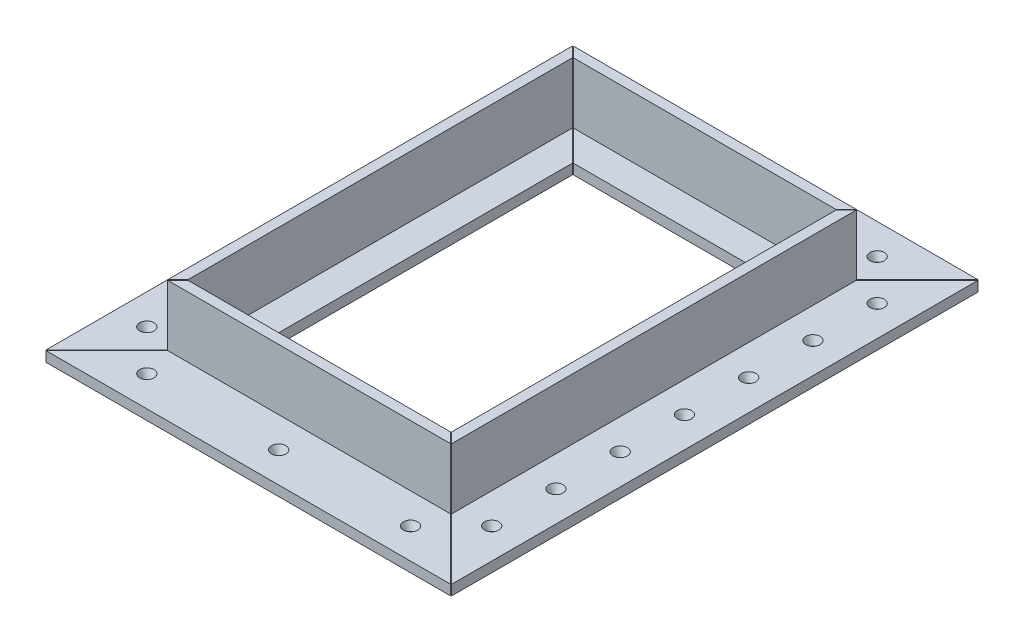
ISO-10303-21;
HEADER;
FILE_DESCRIPTION(('STEP AP214'),'2;1');
FILE_NAME('part.step','',(''),(''),'','','');
FILE_SCHEMA(('AUTOMOTIVE_DESIGN { 1 0 10303 214 1 1 1 1 }'));
ENDSEC;
DATA;
#1=APPLICATION_CONTEXT('core data for automotive mechanical design processes');
#2=APPLICATION_PROTOCOL_DEFINITION('international standard','automotive_design',2000,#1);
#3=PRODUCT_CONTEXT('',#1,'mechanical');
#4=PRODUCT('Part','Part','',(#3));
#5=PRODUCT_RELATED_PRODUCT_CATEGORY('part','',(#4));
#6=PRODUCT_DEFINITION_FORMATION('','',#4);
#7=PRODUCT_DEFINITION_CONTEXT('part definition',#1,'design');
#8=PRODUCT_DEFINITION('design','',#6,#7);
#9=PRODUCT_DEFINITION_SHAPE('','',#8);
#10=(LENGTH_UNIT() NAMED_UNIT(*) SI_UNIT(.MILLI.,.METRE.));
#11=(NAMED_UNIT(*) PLANE_ANGLE_UNIT() SI_UNIT($,.RADIAN.));
#12=(NAMED_UNIT(*) SI_UNIT($,.STERADIAN.) SOLID_ANGLE_UNIT());
#13=UNCERTAINTY_MEASURE_WITH_UNIT(LENGTH_MEASURE(1.E-05),#10,'distance_accuracy_value','');
#14=(GEOMETRIC_REPRESENTATION_CONTEXT(3) GLOBAL_UNCERTAINTY_ASSIGNED_CONTEXT((#13)) GLOBAL_UNIT_ASSIGNED_CONTEXT((#10,
#11,#12)) REPRESENTATION_CONTEXT('',''));
#15=CARTESIAN_POINT('',(0.,0.,0.));
#16=DIRECTION('',(0.,0.,1.));
#17=DIRECTION('',(1.,0.,0.));
#18=AXIS2_PLACEMENT_3D('',#15,#16,#17);
#19=CARTESIAN_POINT('',(-31.75,-19.05,63.5));
#20=DIRECTION('',(0.,-1.,0.));
#21=DIRECTION('',(1.,0.,0.));
#22=AXIS2_PLACEMENT_3D('',#19,#20,#21);
#23=PLANE('',#22);
#24=DIRECTION('',(0.,0.,-1.));
#25=VECTOR('',#24,1.);
#26=CARTESIAN_POINT('',(-31.75,-19.05,63.5));
#27=LINE('',#26,#25);
#28=CARTESIAN_POINT('',(-31.75,-19.05,50.6203948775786));
#29=VERTEX_POINT('',#28);
#30=CARTESIAN_POINT('',(-31.75,-19.05,-50.6203948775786));
#31=VERTEX_POINT('',#30);
#32=EDGE_CURVE('E132',#29,#31,#27,.T.);
#33=ORIENTED_EDGE('',*,*,#32,.T.);
#34=DIRECTION('',(-0.707106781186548,0.,-0.707106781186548));
#35=VECTOR('',#34,1.);
#36=CARTESIAN_POINT('',(25.3101974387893,-19.05,6.4398025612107));
#37=LINE('',#36,#35);
#38=CARTESIAN_POINT('',(-41.275,-19.05,-60.1453948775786));
#39=VERTEX_POINT('',#38);
#40=EDGE_CURVE('E135',#31,#39,#37,.T.);
#41=ORIENTED_EDGE('',*,*,#40,.T.);
#42=DIRECTION('',(0.,0.,-1.));
#43=VECTOR('',#42,1.);
#44=CARTESIAN_POINT('',(-41.275,-19.05,63.5));
#45=LINE('',#44,#43);
#46=CARTESIAN_POINT('',(-41.275,-19.05,60.1453948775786));
#47=VERTEX_POINT('',#46);
#48=EDGE_CURVE('E136',#47,#39,#45,.T.);
#49=ORIENTED_EDGE('',*,*,#48,.F.);
#50=DIRECTION('',(0.707106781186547,0.,-0.707106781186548));
#51=VECTOR('',#50,1.);
#52=CARTESIAN_POINT('',(-38.1898025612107,-19.05,57.0601974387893));
#53=LINE('',#52,#51);
#54=EDGE_CURVE('E149',#47,#29,#53,.T.);
#55=ORIENTED_EDGE('',*,*,#54,.T.);
#56=EDGE_LOOP('',(#33,#41,#49,#55));
#57=FACE_BOUND('',#56,.T.);
#58=ADVANCED_FACE('F43',(#57),#23,.F.);
#59=CARTESIAN_POINT('',(-44.45,0.,63.5));
#60=DIRECTION('',(1.,0.,0.));
#61=DIRECTION('',(0.,0.,-1.));
#62=AXIS2_PLACEMENT_3D('',#59,#60,#61);
#63=PLANE('',#62);
#64=DIRECTION('',(0.,0.,-1.));
#65=VECTOR('',#64,1.);
#66=CARTESIAN_POINT('',(-44.45,0.,63.5));
#67=LINE('',#66,#65);
#68=CARTESIAN_POINT('',(-44.45,0.,63.3203948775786));
#69=VERTEX_POINT('',#68);
#70=CARTESIAN_POINT('',(-44.45,0.,-63.3203948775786));
#71=VERTEX_POINT('',#70);
#72=EDGE_CURVE('E146',#69,#71,#67,.T.);
#73=ORIENTED_EDGE('',*,*,#72,.T.);
#74=DIRECTION('',(0.,-1.,0.));
#75=VECTOR('',#74,1.);
#76=CARTESIAN_POINT('',(-44.45,0.,-63.3203948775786));
#77=LINE('',#76,#75);
#78=CARTESIAN_POINT('',(-44.45,-19.05,-63.3203948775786));
#79=VERTEX_POINT('',#78);
#80=EDGE_CURVE('E59',#71,#79,#77,.T.);
#81=ORIENTED_EDGE('',*,*,#80,.T.);
#82=DIRECTION('',(0.,0.,-1.));
#83=VECTOR('',#82,1.);
#84=CARTESIAN_POINT('',(-44.45,-19.05,63.5));
#85=LINE('',#84,#83);
#86=CARTESIAN_POINT('',(-44.45,-19.05,63.3203948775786));
#87=VERTEX_POINT('',#86);
#88=EDGE_CURVE('E157',#87,#79,#85,.T.);
#89=ORIENTED_EDGE('',*,*,#88,.F.);
#90=DIRECTION('',(0.,1.,0.));
#91=VECTOR('',#90,1.);
#92=CARTESIAN_POINT('',(-44.45,0.,63.3203948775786));
#93=LINE('',#92,#91);
#94=EDGE_CURVE('E179',#87,#69,#93,.T.);
#95=ORIENTED_EDGE('',*,*,#94,.T.);
#96=EDGE_LOOP('',(#73,#81,#89,#95));
#97=FACE_BOUND('',#96,.T.);
#98=ADVANCED_FACE('F247',(#97),#63,.F.);
#99=CARTESIAN_POINT('',(-44.45,-19.05,63.5));
#100=DIRECTION('',(0.,-1.,0.));
#101=DIRECTION('',(1.,0.,0.));
#102=AXIS2_PLACEMENT_3D('',#99,#100,#101);
#103=PLANE('',#102);
#104=CARTESIAN_POINT('',(-53.975,-19.0500000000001,-60.325));
#105=DIRECTION('',(0.,-1.,0.));
#106=DIRECTION('',(1.,0.,0.));
#107=AXIS2_PLACEMENT_3D('',#104,#105,#106);
#108=CIRCLE('',#107,2.25047169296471);
#109=CARTESIAN_POINT('',(-51.7245283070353,-19.0500000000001,-60.325));
#110=VERTEX_POINT('',#109);
#111=EDGE_CURVE('E175',#110,#110,#108,.T.);
#112=ORIENTED_EDGE('',*,*,#111,.T.);
#113=EDGE_LOOP('',(#112));
#114=FACE_BOUND('',#113,.T.);
#115=CARTESIAN_POINT('',(-53.9750000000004,-19.0500000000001,-40.2166666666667));
#116=DIRECTION('',(0.,-1.,0.));
#117=DIRECTION('',(1.,0.,0.));
#118=AXIS2_PLACEMENT_3D('',#115,#116,#117);
#119=CIRCLE('',#118,2.25047169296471);
#120=CARTESIAN_POINT('',(-51.7245283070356,-19.0500000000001,-40.2166666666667));
#121=VERTEX_POINT('',#120);
#122=EDGE_CURVE('E178',#121,#121,#119,.T.);
#123=ORIENTED_EDGE('',*,*,#122,.T.);
#124=EDGE_LOOP('',(#123));
#125=FACE_BOUND('',#124,.T.);
#126=CARTESIAN_POINT('',(-53.975,-19.0500000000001,0.));
#127=DIRECTION('',(0.,-1.,0.));
#128=DIRECTION('',(1.,0.,0.));
#129=AXIS2_PLACEMENT_3D('',#126,#127,#128);
#130=CIRCLE('',#129,2.25047169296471);
#131=CARTESIAN_POINT('',(-51.7245283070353,-19.0500000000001,0.));
#132=VERTEX_POINT('',#131);
#133=EDGE_CURVE('E188',#132,#132,#130,.T.);
#134=ORIENTED_EDGE('',*,*,#133,.T.);
#135=EDGE_LOOP('',(#134));
#136=FACE_BOUND('',#135,.T.);
#137=CARTESIAN_POINT('',(-53.9750000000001,-19.0500000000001,40.2166666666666));
#138=DIRECTION('',(0.,-1.,0.));
#139=DIRECTION('',(1.,0.,0.));
#140=AXIS2_PLACEMENT_3D('',#137,#138,#139);
#141=CIRCLE('',#140,2.25047169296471);
#142=CARTESIAN_POINT('',(-51.7245283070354,-19.0500000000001,40.2166666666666));
#143=VERTEX_POINT('',#142);
#144=EDGE_CURVE('E197',#143,#143,#141,.T.);
#145=ORIENTED_EDGE('',*,*,#144,.T.);
#146=EDGE_LOOP('',(#145));
#147=FACE_BOUND('',#146,.T.);
#148=CARTESIAN_POINT('',(-53.9750000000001,-19.0500000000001,20.1083333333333));
#149=DIRECTION('',(0.,-1.,0.));
#150=DIRECTION('',(1.,0.,0.));
#151=AXIS2_PLACEMENT_3D('',#148,#149,#150);
#152=CIRCLE('',#151,2.25047169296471);
#153=CARTESIAN_POINT('',(-51.7245283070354,-19.0500000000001,20.1083333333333));
#154=VERTEX_POINT('',#153);
#155=EDGE_CURVE('E167',#154,#154,#152,.T.);
#156=ORIENTED_EDGE('',*,*,#155,.T.);
#157=EDGE_LOOP('',(#156));
#158=FACE_BOUND('',#157,.T.);
#159=CARTESIAN_POINT('',(-53.9750000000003,-19.0500000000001,-20.1083333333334));
#160=DIRECTION('',(0.,-1.,0.));
#161=DIRECTION('',(1.,0.,0.));
#162=AXIS2_PLACEMENT_3D('',#159,#160,#161);
#163=CIRCLE('',#162,2.25047169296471);
#164=CARTESIAN_POINT('',(-51.7245283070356,-19.0500000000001,-20.1083333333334));
#165=VERTEX_POINT('',#164);
#166=EDGE_CURVE('E158',#165,#165,#163,.T.);
#167=ORIENTED_EDGE('',*,*,#166,.T.);
#168=EDGE_LOOP('',(#167));
#169=FACE_BOUND('',#168,.T.);
#170=CARTESIAN_POINT('',(-53.975,-19.0500000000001,60.325));
#171=DIRECTION('',(0.,-1.,0.));
#172=DIRECTION('',(1.,0.,0.));
#173=AXIS2_PLACEMENT_3D('',#170,#171,#172);
#174=CIRCLE('',#173,2.25047169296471);
#175=CARTESIAN_POINT('',(-51.7245283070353,-19.0500000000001,60.325));
#176=VERTEX_POINT('',#175);
#177=EDGE_CURVE('E154',#176,#176,#174,.T.);
#178=ORIENTED_EDGE('',*,*,#177,.T.);
#179=EDGE_LOOP('',(#178));
#180=FACE_BOUND('',#179,.T.);
#181=ORIENTED_EDGE('',*,*,#88,.T.);
#182=DIRECTION('',(-0.707106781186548,0.,-0.707106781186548));
#183=VECTOR('',#182,1.);
#184=CARTESIAN_POINT('',(18.9601974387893,-19.05,0.0898025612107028));
#185=LINE('',#184,#183);
#186=CARTESIAN_POINT('',(-63.5,-19.0500000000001,-82.3703948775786));
#187=VERTEX_POINT('',#186);
#188=EDGE_CURVE('E213',#79,#187,#185,.T.);
#189=ORIENTED_EDGE('',*,*,#188,.T.);
#190=DIRECTION('',(0.,0.,-1.));
#191=VECTOR('',#190,1.);
#192=CARTESIAN_POINT('',(-63.5,-19.05,63.5));
#193=LINE('',#192,#191);
#194=CARTESIAN_POINT('',(-63.5,-19.0500000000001,82.3703948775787));
#195=VERTEX_POINT('',#194);
#196=EDGE_CURVE('E120',#195,#187,#193,.T.);
#197=ORIENTED_EDGE('',*,*,#196,.F.);
#198=DIRECTION('',(0.707106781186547,0.,-0.707106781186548));
#199=VECTOR('',#198,1.);
#200=CARTESIAN_POINT('',(-44.5398025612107,-19.05,63.4101974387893));
#201=LINE('',#200,#199);
#202=EDGE_CURVE('E214',#195,#87,#201,.T.);
#203=ORIENTED_EDGE('',*,*,#202,.T.);
#204=EDGE_LOOP('',(#181,#189,#197,#203));
#205=FACE_BOUND('',#204,.T.);
#206=ADVANCED_FACE('F244',(#114,#125,#136,#147,#158,#169,#180,#205),#103,.F.);
#207=CARTESIAN_POINT('',(-63.5,-19.05,63.5));
#208=DIRECTION('',(1.,0.,0.));
#209=DIRECTION('',(0.,0.,-1.));
#210=AXIS2_PLACEMENT_3D('',#207,#208,#209);
#211=PLANE('',#210);
#212=ORIENTED_EDGE('',*,*,#196,.T.);
#213=DIRECTION('',(0.,-1.,0.));
#214=VECTOR('',#213,1.);
#215=CARTESIAN_POINT('',(-63.5,-19.05,-82.3703948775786));
#216=LINE('',#215,#214);
#217=CARTESIAN_POINT('',(-63.5,-22.225,-82.3703948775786));
#218=VERTEX_POINT('',#217);
#219=EDGE_CURVE('E105',#187,#218,#216,.T.);
#220=ORIENTED_EDGE('',*,*,#219,.T.);
#221=DIRECTION('',(0.,0.,-1.));
#222=VECTOR('',#221,1.);
#223=CARTESIAN_POINT('',(-63.5,-22.225,63.5));
#224=LINE('',#223,#222);
#225=CARTESIAN_POINT('',(-63.5,-22.225,82.3703948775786));
#226=VERTEX_POINT('',#225);
#227=EDGE_CURVE('E112',#226,#218,#224,.T.);
#228=ORIENTED_EDGE('',*,*,#227,.F.);
#229=DIRECTION('',(0.,1.,0.));
#230=VECTOR('',#229,1.);
#231=CARTESIAN_POINT('',(-63.5,-19.05,82.3703948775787));
#232=LINE('',#231,#230);
#233=EDGE_CURVE('E121',#226,#195,#232,.T.);
#234=ORIENTED_EDGE('',*,*,#233,.T.);
#235=EDGE_LOOP('',(#212,#220,#228,#234));
#236=FACE_BOUND('',#235,.T.);
#237=ADVANCED_FACE('F117',(#236),#211,.F.);
#238=CARTESIAN_POINT('',(-63.5,-22.225,63.5));
#239=DIRECTION('',(0.,1.,0.));
#240=DIRECTION('',(0.,0.,1.));
#241=AXIS2_PLACEMENT_3D('',#238,#239,#240);
#242=PLANE('',#241);
#243=CARTESIAN_POINT('',(-53.975,-22.225,-60.325));
#244=DIRECTION('',(0.,1.,0.));
#245=DIRECTION('',(0.,0.,1.));
#246=AXIS2_PLACEMENT_3D('',#243,#244,#245);
#247=CIRCLE('',#246,1.04016546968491);
#248=CARTESIAN_POINT('',(-53.975,-22.225,-59.2848345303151));
#249=VERTEX_POINT('',#248);
#250=EDGE_CURVE('E171',#249,#249,#247,.F.);
#251=ORIENTED_EDGE('',*,*,#250,.F.);
#252=EDGE_LOOP('',(#251));
#253=FACE_BOUND('',#252,.T.);
#254=CARTESIAN_POINT('',(-53.9750000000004,-22.225,-40.2166666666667));
#255=DIRECTION('',(0.,1.,0.));
#256=DIRECTION('',(0.,0.,1.));
#257=AXIS2_PLACEMENT_3D('',#254,#255,#256);
#258=CIRCLE('',#257,1.04016546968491);
#259=CARTESIAN_POINT('',(-53.9750000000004,-22.225,-39.1765011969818));
#260=VERTEX_POINT('',#259);
#261=EDGE_CURVE('E182',#260,#260,#258,.F.);
#262=ORIENTED_EDGE('',*,*,#261,.F.);
#263=EDGE_LOOP('',(#262));
#264=FACE_BOUND('',#263,.T.);
#265=CARTESIAN_POINT('',(-53.975,-22.225,0.));
#266=DIRECTION('',(0.,1.,0.));
#267=DIRECTION('',(0.,0.,1.));
#268=AXIS2_PLACEMENT_3D('',#265,#266,#267);
#269=CIRCLE('',#268,1.04016546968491);
#270=CARTESIAN_POINT('',(-53.975,-22.225,1.04016546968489));
#271=VERTEX_POINT('',#270);
#272=EDGE_CURVE('E191',#271,#271,#269,.F.);
#273=ORIENTED_EDGE('',*,*,#272,.F.);
#274=EDGE_LOOP('',(#273));
#275=FACE_BOUND('',#274,.T.);
#276=CARTESIAN_POINT('',(-53.9750000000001,-22.225,40.2166666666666));
#277=DIRECTION('',(0.,1.,0.));
#278=DIRECTION('',(0.,0.,1.));
#279=AXIS2_PLACEMENT_3D('',#276,#277,#278);
#280=CIRCLE('',#279,1.04016546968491);
#281=CARTESIAN_POINT('',(-53.9750000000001,-22.225,41.2568321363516));
#282=VERTEX_POINT('',#281);
#283=EDGE_CURVE('E201',#282,#282,#280,.F.);
#284=ORIENTED_EDGE('',*,*,#283,.F.);
#285=EDGE_LOOP('',(#284));
#286=FACE_BOUND('',#285,.T.);
#287=CARTESIAN_POINT('',(-53.9750000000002,-22.225,20.1083333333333));
#288=DIRECTION('',(0.,1.,0.));
#289=DIRECTION('',(0.,0.,1.));
#290=AXIS2_PLACEMENT_3D('',#287,#288,#289);
#291=CIRCLE('',#290,1.04016546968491);
#292=CARTESIAN_POINT('',(-53.9750000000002,-22.225,21.1484988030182));
#293=VERTEX_POINT('',#292);
#294=EDGE_CURVE('E162',#293,#293,#291,.F.);
#295=ORIENTED_EDGE('',*,*,#294,.F.);
#296=EDGE_LOOP('',(#295));
#297=FACE_BOUND('',#296,.T.);
#298=CARTESIAN_POINT('',(-53.9750000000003,-22.225,-20.1083333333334));
#299=DIRECTION('',(0.,1.,0.));
#300=DIRECTION('',(0.,0.,1.));
#301=AXIS2_PLACEMENT_3D('',#298,#299,#300);
#302=CIRCLE('',#301,1.04016546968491);
#303=CARTESIAN_POINT('',(-53.9750000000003,-22.225,-19.0681678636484));
#304=VERTEX_POINT('',#303);
#305=EDGE_CURVE('E153',#304,#304,#302,.F.);
#306=ORIENTED_EDGE('',*,*,#305,.F.);
#307=EDGE_LOOP('',(#306));
#308=FACE_BOUND('',#307,.T.);
#309=CARTESIAN_POINT('',(-53.975,-22.225,60.325));
#310=DIRECTION('',(0.,1.,0.));
#311=DIRECTION('',(0.,0.,1.));
#312=AXIS2_PLACEMENT_3D('',#309,#310,#311);
#313=CIRCLE('',#312,1.04016546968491);
#314=CARTESIAN_POINT('',(-53.975,-22.225,61.3651654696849));
#315=VERTEX_POINT('',#314);
#316=EDGE_CURVE('E144',#315,#315,#313,.F.);
#317=ORIENTED_EDGE('',*,*,#316,.F.);
#318=EDGE_LOOP('',(#317));
#319=FACE_BOUND('',#318,.T.);
#320=ORIENTED_EDGE('',*,*,#227,.T.);
#321=DIRECTION('',(0.707106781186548,0.,0.707106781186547));
#322=VECTOR('',#321,1.);
#323=CARTESIAN_POINT('',(-31.8398025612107,-22.225,-50.7101974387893));
#324=LINE('',#323,#322);
#325=CARTESIAN_POINT('',(-31.75,-22.225,-50.6203948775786));
#326=VERTEX_POINT('',#325);
#327=EDGE_CURVE('E102',#218,#326,#324,.T.);
#328=ORIENTED_EDGE('',*,*,#327,.T.);
#329=DIRECTION('',(0.,0.,-1.));
#330=VECTOR('',#329,1.);
#331=CARTESIAN_POINT('',(-31.75,-22.225,63.5));
#332=LINE('',#331,#330);
#333=CARTESIAN_POINT('',(-31.75,-22.225,50.6203948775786));
#334=VERTEX_POINT('',#333);
#335=EDGE_CURVE('E130',#334,#326,#332,.T.);
#336=ORIENTED_EDGE('',*,*,#335,.F.);
#337=DIRECTION('',(-0.707106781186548,0.,0.707106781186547));
#338=VECTOR('',#337,1.);
#339=CARTESIAN_POINT('',(-44.5398025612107,-22.225,63.4101974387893));
#340=LINE('',#339,#338);
#341=EDGE_CURVE('E111',#334,#226,#340,.T.);
#342=ORIENTED_EDGE('',*,*,#341,.T.);
#343=EDGE_LOOP('',(#320,#328,#336,#342));
#344=FACE_BOUND('',#343,.T.);
#345=ADVANCED_FACE('F124',(#253,#264,#275,#286,#297,#308,#319,#344),#242,.F.);
#346=CARTESIAN_POINT('',(-31.75,-22.225,63.5));
#347=DIRECTION('',(-1.,0.,0.));
#348=DIRECTION('',(0.,0.,1.));
#349=AXIS2_PLACEMENT_3D('',#346,#347,#348);
#350=PLANE('',#349);
#351=ORIENTED_EDGE('',*,*,#335,.T.);
#352=DIRECTION('',(0.,1.,0.));
#353=VECTOR('',#352,1.);
#354=CARTESIAN_POINT('',(-31.75,-22.225,-50.6203948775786));
#355=LINE('',#354,#353);
#356=EDGE_CURVE('E100',#326,#31,#355,.T.);
#357=ORIENTED_EDGE('',*,*,#356,.T.);
#358=ORIENTED_EDGE('',*,*,#32,.F.);
#359=DIRECTION('',(0.,-1.,0.));
#360=VECTOR('',#359,1.);
#361=CARTESIAN_POINT('',(-31.75,-22.225,50.6203948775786));
#362=LINE('',#361,#360);
#363=EDGE_CURVE('E140',#29,#334,#362,.T.);
#364=ORIENTED_EDGE('',*,*,#363,.T.);
#365=EDGE_LOOP('',(#351,#357,#358,#364));
#366=FACE_BOUND('',#365,.T.);
#367=ADVANCED_FACE('F240',(#366),#350,.F.);
#368=CARTESIAN_POINT('',(-41.275,0.,63.5));
#369=DIRECTION('',(-1.,0.,0.));
#370=DIRECTION('',(0.,0.,1.));
#371=AXIS2_PLACEMENT_3D('',#368,#369,#370);
#372=PLANE('',#371);
#373=ORIENTED_EDGE('',*,*,#48,.T.);
#374=DIRECTION('',(0.,1.,0.));
#375=VECTOR('',#374,1.);
#376=CARTESIAN_POINT('',(-41.275,0.,-60.1453948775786));
#377=LINE('',#376,#375);
#378=CARTESIAN_POINT('',(-41.275,0.,-60.1453948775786));
#379=VERTEX_POINT('',#378);
#380=EDGE_CURVE('E139',#39,#379,#377,.T.);
#381=ORIENTED_EDGE('',*,*,#380,.T.);
#382=DIRECTION('',(0.,0.,-1.));
#383=VECTOR('',#382,1.);
#384=CARTESIAN_POINT('',(-41.275,0.,63.5));
#385=LINE('',#384,#383);
#386=CARTESIAN_POINT('',(-41.275,0.,60.1453948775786));
#387=VERTEX_POINT('',#386);
#388=EDGE_CURVE('E141',#387,#379,#385,.T.);
#389=ORIENTED_EDGE('',*,*,#388,.F.);
#390=DIRECTION('',(0.,-1.,0.));
#391=VECTOR('',#390,1.);
#392=CARTESIAN_POINT('',(-41.275,0.,60.1453948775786));
#393=LINE('',#392,#391);
#394=EDGE_CURVE('E145',#387,#47,#393,.T.);
#395=ORIENTED_EDGE('',*,*,#394,.T.);
#396=EDGE_LOOP('',(#373,#381,#389,#395));
#397=FACE_BOUND('',#396,.T.);
#398=ADVANCED_FACE('F234',(#397),#372,.F.);
#399=CARTESIAN_POINT('',(-44.45,0.,63.5));
#400=DIRECTION('',(0.,-1.,0.));
#401=DIRECTION('',(0.,0.,-1.));
#402=AXIS2_PLACEMENT_3D('',#399,#400,#401);
#403=PLANE('',#402);
#404=ORIENTED_EDGE('',*,*,#388,.T.);
#405=DIRECTION('',(0.707106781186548,0.,0.707106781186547));
#406=VECTOR('',#405,1.);
#407=CARTESIAN_POINT('',(-31.8398025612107,0.,-50.7101974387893));
#408=LINE('',#407,#406);
#409=EDGE_CURVE('E12',#71,#379,#408,.T.);
#410=ORIENTED_EDGE('',*,*,#409,.F.);
#411=ORIENTED_EDGE('',*,*,#72,.F.);
#412=DIRECTION('',(-0.707106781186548,0.,0.707106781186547));
#413=VECTOR('',#412,1.);
#414=CARTESIAN_POINT('',(-44.5398025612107,0.,63.4101974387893));
#415=LINE('',#414,#413);
#416=EDGE_CURVE('E46',#387,#69,#415,.T.);
#417=ORIENTED_EDGE('',*,*,#416,.F.);
#418=EDGE_LOOP('',(#404,#410,#411,#417));
#419=FACE_BOUND('',#418,.T.);
#420=ADVANCED_FACE('F250',(#419),#403,.F.);
#421=CARTESIAN_POINT('',(-53.975,-21.3000448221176,60.325));
#422=DIRECTION('',(0.,1.,0.));
#423=DIRECTION('',(-1.,0.,0.));
#424=AXIS2_PLACEMENT_3D('',#421,#422,#423);
#425=CONICAL_SURFACE('',#424,1.04087553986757,0.000767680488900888);
#426=CARTESIAN_POINT('',(-53.975,-21.3000448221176,60.325));
#427=DIRECTION('',(0.,-1.,0.));
#428=DIRECTION('',(1.,0.,0.));
#429=AXIS2_PLACEMENT_3D('',#426,#427,#428);
#430=CIRCLE('',#429,1.04087553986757);
#431=CARTESIAN_POINT('',(-52.9341244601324,-21.3000448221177,60.325));
#432=VERTEX_POINT('',#431);
#433=EDGE_CURVE('E150',#432,#432,#430,.T.);
#434=ORIENTED_EDGE('',*,*,#433,.F.);
#435=EDGE_LOOP('',(#434));
#436=FACE_BOUND('',#435,.T.);
#437=ORIENTED_EDGE('',*,*,#316,.T.);
#438=EDGE_LOOP('',(#437));
#439=FACE_BOUND('',#438,.T.);
#440=ADVANCED_FACE('F252',(#436,#439),#425,.F.);
#441=CARTESIAN_POINT('',(-53.975,-21.3000448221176,60.325));
#442=DIRECTION('',(0.,1.,0.));
#443=DIRECTION('',(-1.,0.,0.));
#444=AXIS2_PLACEMENT_3D('',#441,#442,#443);
#445=CONICAL_SURFACE('',#444,1.04087553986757,0.493263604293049);
#446=ORIENTED_EDGE('',*,*,#177,.F.);
#447=EDGE_LOOP('',(#446));
#448=FACE_BOUND('',#447,.T.);
#449=ORIENTED_EDGE('',*,*,#433,.T.);
#450=EDGE_LOOP('',(#449));
#451=FACE_BOUND('',#450,.T.);
#452=ADVANCED_FACE('F258',(#448,#451),#445,.F.);
#453=CARTESIAN_POINT('',(-53.9750000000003,-21.3000448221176,-20.1083333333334));
#454=DIRECTION('',(0.,1.,0.));
#455=DIRECTION('',(-1.,0.,0.));
#456=AXIS2_PLACEMENT_3D('',#453,#454,#455);
#457=CONICAL_SURFACE('',#456,1.04087553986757,0.000767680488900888);
#458=CARTESIAN_POINT('',(-53.9750000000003,-21.3000448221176,-20.1083333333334));
#459=DIRECTION('',(0.,-1.,0.));
#460=DIRECTION('',(1.,0.,0.));
#461=AXIS2_PLACEMENT_3D('',#458,#459,#460);
#462=CIRCLE('',#461,1.04087553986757);
#463=CARTESIAN_POINT('',(-52.9341244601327,-21.3000448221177,-20.1083333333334));
#464=VERTEX_POINT('',#463);
#465=EDGE_CURVE('E159',#464,#464,#462,.T.);
#466=ORIENTED_EDGE('',*,*,#465,.F.);
#467=EDGE_LOOP('',(#466));
#468=FACE_BOUND('',#467,.T.);
#469=ORIENTED_EDGE('',*,*,#305,.T.);
#470=EDGE_LOOP('',(#469));
#471=FACE_BOUND('',#470,.T.);
#472=ADVANCED_FACE('F279',(#468,#471),#457,.F.);
#473=CARTESIAN_POINT('',(-53.9750000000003,-21.3000448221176,-20.1083333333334));
#474=DIRECTION('',(0.,1.,0.));
#475=DIRECTION('',(-1.,0.,0.));
#476=AXIS2_PLACEMENT_3D('',#473,#474,#475);
#477=CONICAL_SURFACE('',#476,1.04087553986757,0.493263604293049);
#478=ORIENTED_EDGE('',*,*,#166,.F.);
#479=EDGE_LOOP('',(#478));
#480=FACE_BOUND('',#479,.T.);
#481=ORIENTED_EDGE('',*,*,#465,.T.);
#482=EDGE_LOOP('',(#481));
#483=FACE_BOUND('',#482,.T.);
#484=ADVANCED_FACE('F283',(#480,#483),#477,.F.);
#485=CARTESIAN_POINT('',(-53.9750000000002,-21.3000448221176,20.1083333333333));
#486=DIRECTION('',(0.,1.,0.));
#487=DIRECTION('',(-1.,0.,0.));
#488=AXIS2_PLACEMENT_3D('',#485,#486,#487);
#489=CONICAL_SURFACE('',#488,1.04087553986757,0.000767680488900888);
#490=CARTESIAN_POINT('',(-53.9750000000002,-21.3000448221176,20.1083333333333));
#491=DIRECTION('',(0.,-1.,0.));
#492=DIRECTION('',(1.,0.,0.));
#493=AXIS2_PLACEMENT_3D('',#490,#491,#492);
#494=CIRCLE('',#493,1.04087553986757);
#495=CARTESIAN_POINT('',(-52.9341244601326,-21.3000448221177,20.1083333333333));
#496=VERTEX_POINT('',#495);
#497=EDGE_CURVE('E198',#496,#496,#494,.T.);
#498=ORIENTED_EDGE('',*,*,#497,.F.);
#499=EDGE_LOOP('',(#498));
#500=FACE_BOUND('',#499,.T.);
#501=ORIENTED_EDGE('',*,*,#294,.T.);
#502=EDGE_LOOP('',(#501));
#503=FACE_BOUND('',#502,.T.);
#504=ADVANCED_FACE('F287',(#500,#503),#489,.F.);
#505=CARTESIAN_POINT('',(-53.9750000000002,-21.3000448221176,20.1083333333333));
#506=DIRECTION('',(0.,1.,0.));
#507=DIRECTION('',(-1.,0.,0.));
#508=AXIS2_PLACEMENT_3D('',#505,#506,#507);
#509=CONICAL_SURFACE('',#508,1.04087553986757,0.493263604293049);
#510=ORIENTED_EDGE('',*,*,#155,.F.);
#511=EDGE_LOOP('',(#510));
#512=FACE_BOUND('',#511,.T.);
#513=ORIENTED_EDGE('',*,*,#497,.T.);
#514=EDGE_LOOP('',(#513));
#515=FACE_BOUND('',#514,.T.);
#516=ADVANCED_FACE('F316',(#512,#515),#509,.F.);
#517=CARTESIAN_POINT('',(-53.9750000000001,-21.3000448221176,40.2166666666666));
#518=DIRECTION('',(0.,1.,0.));
#519=DIRECTION('',(-1.,0.,0.));
#520=AXIS2_PLACEMENT_3D('',#517,#518,#519);
#521=CONICAL_SURFACE('',#520,1.04087553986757,0.000767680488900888);
#522=CARTESIAN_POINT('',(-53.9750000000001,-21.3000448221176,40.2166666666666));
#523=DIRECTION('',(0.,-1.,0.));
#524=DIRECTION('',(1.,0.,0.));
#525=AXIS2_PLACEMENT_3D('',#522,#523,#524);
#526=CIRCLE('',#525,1.04087553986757);
#527=CARTESIAN_POINT('',(-52.9341244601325,-21.3000448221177,40.2166666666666));
#528=VERTEX_POINT('',#527);
#529=EDGE_CURVE('E194',#528,#528,#526,.T.);
#530=ORIENTED_EDGE('',*,*,#529,.F.);
#531=EDGE_LOOP('',(#530));
#532=FACE_BOUND('',#531,.T.);
#533=ORIENTED_EDGE('',*,*,#283,.T.);
#534=EDGE_LOOP('',(#533));
#535=FACE_BOUND('',#534,.T.);
#536=ADVANCED_FACE('F320',(#532,#535),#521,.F.);
#537=CARTESIAN_POINT('',(-53.9750000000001,-21.3000448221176,40.2166666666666));
#538=DIRECTION('',(0.,1.,0.));
#539=DIRECTION('',(-1.,0.,0.));
#540=AXIS2_PLACEMENT_3D('',#537,#538,#539);
#541=CONICAL_SURFACE('',#540,1.04087553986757,0.493263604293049);
#542=ORIENTED_EDGE('',*,*,#144,.F.);
#543=EDGE_LOOP('',(#542));
#544=FACE_BOUND('',#543,.T.);
#545=ORIENTED_EDGE('',*,*,#529,.T.);
#546=EDGE_LOOP('',(#545));
#547=FACE_BOUND('',#546,.T.);
#548=ADVANCED_FACE('F309',(#544,#547),#541,.F.);
#549=CARTESIAN_POINT('',(-53.975,-21.3000448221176,0.));
#550=DIRECTION('',(0.,1.,0.));
#551=DIRECTION('',(-1.,0.,0.));
#552=AXIS2_PLACEMENT_3D('',#549,#550,#551);
#553=CONICAL_SURFACE('',#552,1.04087553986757,0.000767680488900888);
#554=CARTESIAN_POINT('',(-53.975,-21.3000448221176,0.));
#555=DIRECTION('',(0.,-1.,0.));
#556=DIRECTION('',(1.,0.,0.));
#557=AXIS2_PLACEMENT_3D('',#554,#555,#556);
#558=CIRCLE('',#557,1.04087553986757);
#559=CARTESIAN_POINT('',(-52.9341244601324,-21.3000448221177,0.));
#560=VERTEX_POINT('',#559);
#561=EDGE_CURVE('E185',#560,#560,#558,.T.);
#562=ORIENTED_EDGE('',*,*,#561,.F.);
#563=EDGE_LOOP('',(#562));
#564=FACE_BOUND('',#563,.T.);
#565=ORIENTED_EDGE('',*,*,#272,.T.);
#566=EDGE_LOOP('',(#565));
#567=FACE_BOUND('',#566,.T.);
#568=ADVANCED_FACE('F306',(#564,#567),#553,.F.);
#569=CARTESIAN_POINT('',(-53.975,-21.3000448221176,0.));
#570=DIRECTION('',(0.,1.,0.));
#571=DIRECTION('',(-1.,0.,0.));
#572=AXIS2_PLACEMENT_3D('',#569,#570,#571);
#573=CONICAL_SURFACE('',#572,1.04087553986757,0.493263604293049);
#574=ORIENTED_EDGE('',*,*,#133,.F.);
#575=EDGE_LOOP('',(#574));
#576=FACE_BOUND('',#575,.T.);
#577=ORIENTED_EDGE('',*,*,#561,.T.);
#578=EDGE_LOOP('',(#577));
#579=FACE_BOUND('',#578,.T.);
#580=ADVANCED_FACE('F301',(#576,#579),#573,.F.);
#581=CARTESIAN_POINT('',(-53.9750000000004,-21.3000448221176,-40.2166666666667));
#582=DIRECTION('',(0.,1.,0.));
#583=DIRECTION('',(-1.,0.,0.));
#584=AXIS2_PLACEMENT_3D('',#581,#582,#583);
#585=CONICAL_SURFACE('',#584,1.04087553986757,0.000767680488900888);
#586=CARTESIAN_POINT('',(-53.9750000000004,-21.3000448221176,-40.2166666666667));
#587=DIRECTION('',(0.,-1.,0.));
#588=DIRECTION('',(1.,0.,0.));
#589=AXIS2_PLACEMENT_3D('',#586,#587,#588);
#590=CIRCLE('',#589,1.04087553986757);
#591=CARTESIAN_POINT('',(-52.9341244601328,-21.3000448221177,-40.2166666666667));
#592=VERTEX_POINT('',#591);
#593=EDGE_CURVE('E174',#592,#592,#590,.T.);
#594=ORIENTED_EDGE('',*,*,#593,.F.);
#595=EDGE_LOOP('',(#594));
#596=FACE_BOUND('',#595,.T.);
#597=ORIENTED_EDGE('',*,*,#261,.T.);
#598=EDGE_LOOP('',(#597));
#599=FACE_BOUND('',#598,.T.);
#600=ADVANCED_FACE('F298',(#596,#599),#585,.F.);
#601=CARTESIAN_POINT('',(-53.9750000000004,-21.3000448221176,-40.2166666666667));
#602=DIRECTION('',(0.,1.,0.));
#603=DIRECTION('',(-1.,0.,0.));
#604=AXIS2_PLACEMENT_3D('',#601,#602,#603);
#605=CONICAL_SURFACE('',#604,1.04087553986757,0.493263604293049);
#606=ORIENTED_EDGE('',*,*,#122,.F.);
#607=EDGE_LOOP('',(#606));
#608=FACE_BOUND('',#607,.T.);
#609=ORIENTED_EDGE('',*,*,#593,.T.);
#610=EDGE_LOOP('',(#609));
#611=FACE_BOUND('',#610,.T.);
#612=ADVANCED_FACE('F293',(#608,#611),#605,.F.);
#613=CARTESIAN_POINT('',(-53.975,-21.3000448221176,-60.325));
#614=DIRECTION('',(0.,1.,0.));
#615=DIRECTION('',(-1.,0.,0.));
#616=AXIS2_PLACEMENT_3D('',#613,#614,#615);
#617=CONICAL_SURFACE('',#616,1.04087553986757,0.000767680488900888);
#618=CARTESIAN_POINT('',(-53.975,-21.3000448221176,-60.325));
#619=DIRECTION('',(0.,-1.,0.));
#620=DIRECTION('',(1.,0.,0.));
#621=AXIS2_PLACEMENT_3D('',#618,#619,#620);
#622=CIRCLE('',#621,1.04087553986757);
#623=CARTESIAN_POINT('',(-52.9341244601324,-21.3000448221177,-60.325));
#624=VERTEX_POINT('',#623);
#625=EDGE_CURVE('E168',#624,#624,#622,.T.);
#626=ORIENTED_EDGE('',*,*,#625,.F.);
#627=EDGE_LOOP('',(#626));
#628=FACE_BOUND('',#627,.T.);
#629=ORIENTED_EDGE('',*,*,#250,.T.);
#630=EDGE_LOOP('',(#629));
#631=FACE_BOUND('',#630,.T.);
#632=ADVANCED_FACE('F289',(#628,#631),#617,.F.);
#633=CARTESIAN_POINT('',(-53.975,-21.3000448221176,-60.325));
#634=DIRECTION('',(0.,1.,0.));
#635=DIRECTION('',(-1.,0.,0.));
#636=AXIS2_PLACEMENT_3D('',#633,#634,#635);
#637=CONICAL_SURFACE('',#636,1.04087553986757,0.493263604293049);
#638=ORIENTED_EDGE('',*,*,#111,.F.);
#639=EDGE_LOOP('',(#638));
#640=FACE_BOUND('',#639,.T.);
#641=ORIENTED_EDGE('',*,*,#625,.T.);
#642=EDGE_LOOP('',(#641));
#643=FACE_BOUND('',#642,.T.);
#644=ADVANCED_FACE('F292',(#640,#643),#637,.F.);
#645=CARTESIAN_POINT('',(-41.3648025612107,-22.225,60.2351974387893));
#646=DIRECTION('',(-0.707106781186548,0.,-0.707106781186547));
#647=DIRECTION('',(-0.707106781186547,0.,0.707106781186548));
#648=AXIS2_PLACEMENT_3D('',#645,#646,#647);
#649=PLANE('',#648);
#650=ORIENTED_EDGE('',*,*,#202,.F.);
#651=ORIENTED_EDGE('',*,*,#233,.F.);
#652=ORIENTED_EDGE('',*,*,#341,.F.);
#653=ORIENTED_EDGE('',*,*,#363,.F.);
#654=ORIENTED_EDGE('',*,*,#54,.F.);
#655=ORIENTED_EDGE('',*,*,#394,.F.);
#656=ORIENTED_EDGE('',*,*,#416,.T.);
#657=ORIENTED_EDGE('',*,*,#94,.F.);
#658=EDGE_LOOP('',(#650,#651,#652,#653,#654,#655,#656,#657));
#659=FACE_BOUND('',#658,.T.);
#660=ADVANCED_FACE('F241',(#659),#649,.F.);
#661=CARTESIAN_POINT('',(-41.3648025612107,-22.225,-60.2351974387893));
#662=DIRECTION('',(-0.707106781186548,0.,0.707106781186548));
#663=DIRECTION('',(0.707106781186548,0.,0.707106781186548));
#664=AXIS2_PLACEMENT_3D('',#661,#662,#663);
#665=PLANE('',#664);
#666=ORIENTED_EDGE('',*,*,#409,.T.);
#667=ORIENTED_EDGE('',*,*,#380,.F.);
#668=ORIENTED_EDGE('',*,*,#40,.F.);
#669=ORIENTED_EDGE('',*,*,#356,.F.);
#670=ORIENTED_EDGE('',*,*,#327,.F.);
#671=ORIENTED_EDGE('',*,*,#219,.F.);
#672=ORIENTED_EDGE('',*,*,#188,.F.);
#673=ORIENTED_EDGE('',*,*,#80,.F.);
#674=EDGE_LOOP('',(#666,#667,#668,#669,#670,#671,#672,#673));
#675=FACE_BOUND('',#674,.T.);
#676=ADVANCED_FACE('F104',(#675),#665,.F.);
#677=CLOSED_SHELL('',(#58,#98,#206,#237,#345,#367,#398,#420,#440,#452,#472,#484,#504,#516,#536,
#548,#568,#580,#600,#612,#632,#644,#660,#676));
#678=MANIFOLD_SOLID_BREP('B2',#677);
#679=CARTESIAN_POINT('',(41.275,-21.3000448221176,-73.025));
#680=DIRECTION('',(0.,1.,0.));
#681=DIRECTION('',(-1.,0.,0.));
#682=AXIS2_PLACEMENT_3D('',#679,#680,#681);
#683=CONICAL_SURFACE('',#682,1.04087553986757,0.493263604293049);
#684=CARTESIAN_POINT('',(41.275,-19.0500000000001,-73.025));
#685=DIRECTION('',(0.,-1.,0.));
#686=DIRECTION('',(1.,0.,0.));
#687=AXIS2_PLACEMENT_3D('',#684,#685,#686);
#688=CIRCLE('',#687,2.25047169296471);
#689=CARTESIAN_POINT('',(43.5254716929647,-19.0500000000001,-73.025));
#690=VERTEX_POINT('',#689);
#691=EDGE_CURVE('E733',#690,#690,#688,.T.);
#692=ORIENTED_EDGE('',*,*,#691,.F.);
#693=EDGE_LOOP('',(#692));
#694=FACE_BOUND('',#693,.T.);
#695=CARTESIAN_POINT('',(41.275,-21.3000448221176,-73.025));
#696=DIRECTION('',(0.,-1.,0.));
#697=DIRECTION('',(1.,0.,0.));
#698=AXIS2_PLACEMENT_3D('',#695,#696,#697);
#699=CIRCLE('',#698,1.04087553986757);
#700=CARTESIAN_POINT('',(42.3158755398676,-21.3000448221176,-73.025));
#701=VERTEX_POINT('',#700);
#702=EDGE_CURVE('E724',#701,#701,#699,.T.);
#703=ORIENTED_EDGE('',*,*,#702,.T.);
#704=EDGE_LOOP('',(#703));
#705=FACE_BOUND('',#704,.T.);
#706=ADVANCED_FACE('F616',(#694,#705),#683,.F.);
#707=CARTESIAN_POINT('',(0.,-21.3000448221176,-73.025));
#708=DIRECTION('',(0.,1.,0.));
#709=DIRECTION('',(-1.,0.,0.));
#710=AXIS2_PLACEMENT_3D('',#707,#708,#709);
#711=CONICAL_SURFACE('',#710,1.04087553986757,0.493263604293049);
#712=CARTESIAN_POINT('',(0.,-19.0500000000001,-73.025));
#713=DIRECTION('',(0.,-1.,0.));
#714=DIRECTION('',(1.,0.,0.));
#715=AXIS2_PLACEMENT_3D('',#712,#713,#714);
#716=CIRCLE('',#715,2.25047169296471);
#717=CARTESIAN_POINT('',(2.25047169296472,-19.0500000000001,-73.025));
#718=VERTEX_POINT('',#717);
#719=EDGE_CURVE('E700',#718,#718,#716,.T.);
#720=ORIENTED_EDGE('',*,*,#719,.F.);
#721=EDGE_LOOP('',(#720));
#722=FACE_BOUND('',#721,.T.);
#723=CARTESIAN_POINT('',(0.,-21.3000448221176,-73.025));
#724=DIRECTION('',(0.,-1.,0.));
#725=DIRECTION('',(1.,0.,0.));
#726=AXIS2_PLACEMENT_3D('',#723,#724,#725);
#727=CIRCLE('',#726,1.04087553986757);
#728=CARTESIAN_POINT('',(1.04087553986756,-21.3000448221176,-73.025));
#729=VERTEX_POINT('',#728);
#730=EDGE_CURVE('E727',#729,#729,#727,.T.);
#731=ORIENTED_EDGE('',*,*,#730,.T.);
#732=EDGE_LOOP('',(#731));
#733=FACE_BOUND('',#732,.T.);
#734=ADVANCED_FACE('F800',(#722,#733),#711,.F.);
#735=CARTESIAN_POINT('',(-41.275,-21.3000448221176,-73.025));
#736=DIRECTION('',(0.,1.,0.));
#737=DIRECTION('',(-1.,0.,0.));
#738=AXIS2_PLACEMENT_3D('',#735,#736,#737);
#739=CONICAL_SURFACE('',#738,1.04087553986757,0.493263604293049);
#740=CARTESIAN_POINT('',(-41.275,-19.0500000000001,-73.025));
#741=DIRECTION('',(0.,-1.,0.));
#742=DIRECTION('',(1.,0.,0.));
#743=AXIS2_PLACEMENT_3D('',#740,#741,#742);
#744=CIRCLE('',#743,2.25047169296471);
#745=CARTESIAN_POINT('',(-39.0245283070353,-19.0500000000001,-73.025));
#746=VERTEX_POINT('',#745);
#747=EDGE_CURVE('E697',#746,#746,#744,.T.);
#748=ORIENTED_EDGE('',*,*,#747,.F.);
#749=EDGE_LOOP('',(#748));
#750=FACE_BOUND('',#749,.T.);
#751=CARTESIAN_POINT('',(-41.275,-21.3000448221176,-73.025));
#752=DIRECTION('',(0.,-1.,0.));
#753=DIRECTION('',(1.,0.,0.));
#754=AXIS2_PLACEMENT_3D('',#751,#752,#753);
#755=CIRCLE('',#754,1.04087553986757);
#756=CARTESIAN_POINT('',(-40.2341244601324,-21.3000448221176,-73.025));
#757=VERTEX_POINT('',#756);
#758=EDGE_CURVE('E732',#757,#757,#755,.T.);
#759=ORIENTED_EDGE('',*,*,#758,.T.);
#760=EDGE_LOOP('',(#759));
#761=FACE_BOUND('',#760,.T.);
#762=ADVANCED_FACE('F806',(#750,#761),#739,.F.);
#763=CARTESIAN_POINT('',(41.275,-21.3000448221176,-73.025));
#764=DIRECTION('',(0.,1.,0.));
#765=DIRECTION('',(-1.,0.,0.));
#766=AXIS2_PLACEMENT_3D('',#763,#764,#765);
#767=CONICAL_SURFACE('',#766,1.04087553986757,0.000767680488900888);
#768=ORIENTED_EDGE('',*,*,#702,.F.);
#769=EDGE_LOOP('',(#768));
#770=FACE_BOUND('',#769,.T.);
#771=CARTESIAN_POINT('',(41.275,-22.225,-73.0250000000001));
#772=DIRECTION('',(0.,1.,0.));
#773=DIRECTION('',(0.,0.,1.));
#774=AXIS2_PLACEMENT_3D('',#771,#772,#773);
#775=CIRCLE('',#774,1.04016546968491);
#776=CARTESIAN_POINT('',(41.275,-22.225,-71.9848345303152));
#777=VERTEX_POINT('',#776);
#778=EDGE_CURVE('E728',#777,#777,#775,.F.);
#779=ORIENTED_EDGE('',*,*,#778,.T.);
#780=EDGE_LOOP('',(#779));
#781=FACE_BOUND('',#780,.T.);
#782=ADVANCED_FACE('F813',(#770,#781),#767,.F.);
#783=CARTESIAN_POINT('',(0.,-21.3000448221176,-73.025));
#784=DIRECTION('',(0.,1.,0.));
#785=DIRECTION('',(-1.,0.,0.));
#786=AXIS2_PLACEMENT_3D('',#783,#784,#785);
#787=CONICAL_SURFACE('',#786,1.04087553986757,0.000767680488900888);
#788=ORIENTED_EDGE('',*,*,#730,.F.);
#789=EDGE_LOOP('',(#788));
#790=FACE_BOUND('',#789,.T.);
#791=CARTESIAN_POINT('',(0.,-22.225,-73.025));
#792=DIRECTION('',(0.,1.,0.));
#793=DIRECTION('',(0.,0.,1.));
#794=AXIS2_PLACEMENT_3D('',#791,#792,#793);
#795=CIRCLE('',#794,1.04016546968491);
#796=CARTESIAN_POINT('',(0.,-22.225,-71.9848345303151));
#797=VERTEX_POINT('',#796);
#798=EDGE_CURVE('E731',#797,#797,#795,.F.);
#799=ORIENTED_EDGE('',*,*,#798,.T.);
#800=EDGE_LOOP('',(#799));
#801=FACE_BOUND('',#800,.T.);
#802=ADVANCED_FACE('F815',(#790,#801),#787,.F.);
#803=CARTESIAN_POINT('',(-41.275,-21.3000448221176,-73.025));
#804=DIRECTION('',(0.,1.,0.));
#805=DIRECTION('',(-1.,0.,0.));
#806=AXIS2_PLACEMENT_3D('',#803,#804,#805);
#807=CONICAL_SURFACE('',#806,1.04087553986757,0.000767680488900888);
#808=ORIENTED_EDGE('',*,*,#758,.F.);
#809=EDGE_LOOP('',(#808));
#810=FACE_BOUND('',#809,.T.);
#811=CARTESIAN_POINT('',(-41.275,-22.225,-73.025));
#812=DIRECTION('',(0.,1.,0.));
#813=DIRECTION('',(0.,0.,1.));
#814=AXIS2_PLACEMENT_3D('',#811,#812,#813);
#815=CIRCLE('',#814,1.04016546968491);
#816=CARTESIAN_POINT('',(-41.275,-22.225,-71.9848345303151));
#817=VERTEX_POINT('',#816);
#818=EDGE_CURVE('E740',#817,#817,#815,.F.);
#819=ORIENTED_EDGE('',*,*,#818,.T.);
#820=EDGE_LOOP('',(#819));
#821=FACE_BOUND('',#820,.T.);
#822=ADVANCED_FACE('F817',(#810,#821),#807,.F.);
#823=CARTESIAN_POINT('',(-44.45,-19.05,-50.8));
#824=DIRECTION('',(0.,0.,1.));
#825=DIRECTION('',(1.,0.,0.));
#826=AXIS2_PLACEMENT_3D('',#823,#824,#825);
#827=PLANE('',#826);
#828=DIRECTION('',(1.,0.,0.));
#829=VECTOR('',#828,1.);
#830=CARTESIAN_POINT('',(-44.45,-19.05,-50.8));
#831=LINE('',#830,#829);
#832=CARTESIAN_POINT('',(-31.5703948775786,-19.05,-50.8));
#833=VERTEX_POINT('',#832);
#834=CARTESIAN_POINT('',(31.5703948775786,-19.05,-50.8));
#835=VERTEX_POINT('',#834);
#836=EDGE_CURVE('E709',#833,#835,#831,.T.);
#837=ORIENTED_EDGE('',*,*,#836,.F.);
#838=DIRECTION('',(0.,-1.,0.));
#839=VECTOR('',#838,1.);
#840=CARTESIAN_POINT('',(-31.5703948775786,-19.05,-50.8));
#841=LINE('',#840,#839);
#842=CARTESIAN_POINT('',(-31.5703948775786,-22.225,-50.8));
#843=VERTEX_POINT('',#842);
#844=EDGE_CURVE('E717',#833,#843,#841,.T.);
#845=ORIENTED_EDGE('',*,*,#844,.T.);
#846=DIRECTION('',(1.,0.,0.));
#847=VECTOR('',#846,1.);
#848=CARTESIAN_POINT('',(-44.45,-22.225,-50.8));
#849=LINE('',#848,#847);
#850=CARTESIAN_POINT('',(31.5703948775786,-22.225,-50.8));
#851=VERTEX_POINT('',#850);
#852=EDGE_CURVE('E713',#843,#851,#849,.T.);
#853=ORIENTED_EDGE('',*,*,#852,.T.);
#854=DIRECTION('',(0.,-1.,0.));
#855=VECTOR('',#854,1.);
#856=CARTESIAN_POINT('',(31.5703948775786,-19.0499999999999,-50.8));
#857=LINE('',#856,#855);
#858=EDGE_CURVE('E756',#835,#851,#857,.T.);
#859=ORIENTED_EDGE('',*,*,#858,.F.);
#860=EDGE_LOOP('',(#837,#845,#853,#859));
#861=FACE_BOUND('',#860,.T.);
#862=ADVANCED_FACE('F773',(#861),#827,.T.);
#863=CARTESIAN_POINT('',(-44.45,-19.05,-82.55));
#864=DIRECTION('',(0.,0.,-1.));
#865=DIRECTION('',(0.,1.,0.));
#866=AXIS2_PLACEMENT_3D('',#863,#864,#865);
#867=PLANE('',#866);
#868=DIRECTION('',(1.,0.,0.));
#869=VECTOR('',#868,1.);
#870=CARTESIAN_POINT('',(-44.45,-22.2249999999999,-82.55));
#871=LINE('',#870,#869);
#872=CARTESIAN_POINT('',(-63.3203948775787,-22.225,-82.55));
#873=VERTEX_POINT('',#872);
#874=CARTESIAN_POINT('',(63.3203948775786,-22.2249999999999,-82.55));
#875=VERTEX_POINT('',#874);
#876=EDGE_CURVE('E718',#873,#875,#871,.T.);
#877=ORIENTED_EDGE('',*,*,#876,.F.);
#878=DIRECTION('',(0.,1.,0.));
#879=VECTOR('',#878,1.);
#880=CARTESIAN_POINT('',(-63.3203948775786,-19.0499999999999,-82.55));
#881=LINE('',#880,#879);
#882=CARTESIAN_POINT('',(-63.3203948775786,-19.05,-82.55));
#883=VERTEX_POINT('',#882);
#884=EDGE_CURVE('E716',#873,#883,#881,.T.);
#885=ORIENTED_EDGE('',*,*,#884,.T.);
#886=DIRECTION('',(1.,0.,0.));
#887=VECTOR('',#886,1.);
#888=CARTESIAN_POINT('',(-44.45,-19.05,-82.55));
#889=LINE('',#888,#887);
#890=CARTESIAN_POINT('',(63.3203948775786,-19.0500000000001,-82.55));
#891=VERTEX_POINT('',#890);
#892=EDGE_CURVE('E721',#883,#891,#889,.T.);
#893=ORIENTED_EDGE('',*,*,#892,.T.);
#894=DIRECTION('',(0.,1.,0.));
#895=VECTOR('',#894,1.);
#896=CARTESIAN_POINT('',(63.3203948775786,-19.0499999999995,-82.55));
#897=LINE('',#896,#895);
#898=EDGE_CURVE('E692',#875,#891,#897,.T.);
#899=ORIENTED_EDGE('',*,*,#898,.F.);
#900=EDGE_LOOP('',(#877,#885,#893,#899));
#901=FACE_BOUND('',#900,.T.);
#902=ADVANCED_FACE('F780',(#901),#867,.T.);
#903=CARTESIAN_POINT('',(-63.5,-22.225,63.5));
#904=DIRECTION('',(0.,1.,0.));
#905=DIRECTION('',(0.,0.,1.));
#906=AXIS2_PLACEMENT_3D('',#903,#904,#905);
#907=PLANE('',#906);
#908=ORIENTED_EDGE('',*,*,#818,.F.);
#909=EDGE_LOOP('',(#908));
#910=FACE_BOUND('',#909,.T.);
#911=ORIENTED_EDGE('',*,*,#798,.F.);
#912=EDGE_LOOP('',(#911));
#913=FACE_BOUND('',#912,.T.);
#914=ORIENTED_EDGE('',*,*,#778,.F.);
#915=EDGE_LOOP('',(#914));
#916=FACE_BOUND('',#915,.T.);
#917=DIRECTION('',(0.707106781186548,0.,0.707106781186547));
#918=VECTOR('',#917,1.);
#919=CARTESIAN_POINT('',(-31.6601974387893,-22.225,-50.8898025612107));
#920=LINE('',#919,#918);
#921=EDGE_CURVE('E626',#873,#843,#920,.T.);
#922=ORIENTED_EDGE('',*,*,#921,.F.);
#923=ORIENTED_EDGE('',*,*,#876,.T.);
#924=DIRECTION('',(-0.707106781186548,0.,0.707106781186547));
#925=VECTOR('',#924,1.);
#926=CARTESIAN_POINT('',(6.20663345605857,-22.225,-25.43623857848));
#927=LINE('',#926,#925);
#928=EDGE_CURVE('E682',#875,#851,#927,.T.);
#929=ORIENTED_EDGE('',*,*,#928,.T.);
#930=ORIENTED_EDGE('',*,*,#852,.F.);
#931=EDGE_LOOP('',(#922,#923,#929,#930));
#932=FACE_BOUND('',#931,.T.);
#933=ADVANCED_FACE('F775',(#910,#913,#916,#932),#907,.F.);
#934=CARTESIAN_POINT('',(0.,0.,-63.5));
#935=DIRECTION('',(0.,0.,1.));
#936=DIRECTION('',(1.,0.,0.));
#937=AXIS2_PLACEMENT_3D('',#934,#935,#936);
#938=PLANE('',#937);
#939=DIRECTION('',(0.,-1.,0.));
#940=VECTOR('',#939,1.);
#941=CARTESIAN_POINT('',(-44.2703948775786,0.,-63.5));
#942=LINE('',#941,#940);
#943=CARTESIAN_POINT('',(-44.2703948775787,0.,-63.5));
#944=VERTEX_POINT('',#943);
#945=CARTESIAN_POINT('',(-44.2703948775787,-19.05,-63.5));
#946=VERTEX_POINT('',#945);
#947=EDGE_CURVE('E691',#944,#946,#942,.T.);
#948=ORIENTED_EDGE('',*,*,#947,.F.);
#949=DIRECTION('',(-1.,0.,0.));
#950=VECTOR('',#949,1.);
#951=CARTESIAN_POINT('',(-44.45,0.,-63.5));
#952=LINE('',#951,#950);
#953=CARTESIAN_POINT('',(44.2703948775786,0.,-63.5));
#954=VERTEX_POINT('',#953);
#955=EDGE_CURVE('E688',#954,#944,#952,.T.);
#956=ORIENTED_EDGE('',*,*,#955,.F.);
#957=DIRECTION('',(0.,-1.,0.));
#958=VECTOR('',#957,1.);
#959=CARTESIAN_POINT('',(44.2703948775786,0.,-63.5));
#960=LINE('',#959,#958);
#961=CARTESIAN_POINT('',(44.2703948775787,-19.05,-63.5));
#962=VERTEX_POINT('',#961);
#963=EDGE_CURVE('E670',#954,#962,#960,.T.);
#964=ORIENTED_EDGE('',*,*,#963,.T.);
#965=DIRECTION('',(-1.,0.,0.));
#966=VECTOR('',#965,1.);
#967=CARTESIAN_POINT('',(0.,-19.05,-63.5));
#968=LINE('',#967,#966);
#969=EDGE_CURVE('E681',#962,#946,#968,.T.);
#970=ORIENTED_EDGE('',*,*,#969,.T.);
#971=EDGE_LOOP('',(#948,#956,#964,#970));
#972=FACE_BOUND('',#971,.T.);
#973=ADVANCED_FACE('F695',(#972),#938,.F.);
#974=CARTESIAN_POINT('',(-44.45,0.,-60.325));
#975=DIRECTION('',(0.,0.,1.));
#976=DIRECTION('',(1.,0.,0.));
#977=AXIS2_PLACEMENT_3D('',#974,#975,#976);
#978=PLANE('',#977);
#979=DIRECTION('',(1.,0.,0.));
#980=VECTOR('',#979,1.);
#981=CARTESIAN_POINT('',(-44.45,0.,-60.325));
#982=LINE('',#981,#980);
#983=CARTESIAN_POINT('',(-41.0953948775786,0.,-60.325));
#984=VERTEX_POINT('',#983);
#985=CARTESIAN_POINT('',(41.0953948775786,0.,-60.325));
#986=VERTEX_POINT('',#985);
#987=EDGE_CURVE('E690',#984,#986,#982,.T.);
#988=ORIENTED_EDGE('',*,*,#987,.F.);
#989=DIRECTION('',(0.,-1.,0.));
#990=VECTOR('',#989,1.);
#991=CARTESIAN_POINT('',(-41.0953948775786,0.,-60.325));
#992=LINE('',#991,#990);
#993=CARTESIAN_POINT('',(-41.0953948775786,-19.05,-60.325));
#994=VERTEX_POINT('',#993);
#995=EDGE_CURVE('E634',#984,#994,#992,.T.);
#996=ORIENTED_EDGE('',*,*,#995,.T.);
#997=DIRECTION('',(1.,0.,0.));
#998=VECTOR('',#997,1.);
#999=CARTESIAN_POINT('',(-44.45,-19.05,-60.325));
#1000=LINE('',#999,#998);
#1001=CARTESIAN_POINT('',(41.0953948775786,-19.05,-60.325));
#1002=VERTEX_POINT('',#1001);
#1003=EDGE_CURVE('E706',#994,#1002,#1000,.T.);
#1004=ORIENTED_EDGE('',*,*,#1003,.T.);
#1005=DIRECTION('',(0.,-1.,0.));
#1006=VECTOR('',#1005,1.);
#1007=CARTESIAN_POINT('',(41.0953948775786,0.,-60.325));
#1008=LINE('',#1007,#1006);
#1009=EDGE_CURVE('E754',#986,#1002,#1008,.T.);
#1010=ORIENTED_EDGE('',*,*,#1009,.F.);
#1011=EDGE_LOOP('',(#988,#996,#1004,#1010));
#1012=FACE_BOUND('',#1011,.T.);
#1013=ADVANCED_FACE('F788',(#1012),#978,.T.);
#1014=CARTESIAN_POINT('',(-44.45,0.,63.5));
#1015=DIRECTION('',(0.,-1.,0.));
#1016=DIRECTION('',(0.,0.,-1.));
#1017=AXIS2_PLACEMENT_3D('',#1014,#1015,#1016);
#1018=PLANE('',#1017);
#1019=DIRECTION('',(0.707106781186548,0.,0.707106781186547));
#1020=VECTOR('',#1019,1.);
#1021=CARTESIAN_POINT('',(-31.6601974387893,0.,-50.8898025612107));
#1022=LINE('',#1021,#1020);
#1023=EDGE_CURVE('E620',#944,#984,#1022,.T.);
#1024=ORIENTED_EDGE('',*,*,#1023,.T.);
#1025=ORIENTED_EDGE('',*,*,#987,.T.);
#1026=DIRECTION('',(-0.707106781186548,0.,0.707106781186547));
#1027=VECTOR('',#1026,1.);
#1028=CARTESIAN_POINT('',(6.20663345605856,0.,-25.43623857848));
#1029=LINE('',#1028,#1027);
#1030=EDGE_CURVE('E673',#954,#986,#1029,.T.);
#1031=ORIENTED_EDGE('',*,*,#1030,.F.);
#1032=ORIENTED_EDGE('',*,*,#955,.T.);
#1033=EDGE_LOOP('',(#1024,#1025,#1031,#1032));
#1034=FACE_BOUND('',#1033,.T.);
#1035=ADVANCED_FACE('F687',(#1034),#1018,.F.);
#1036=CARTESIAN_POINT('',(-44.45,-19.05,63.5));
#1037=DIRECTION('',(0.,-1.,0.));
#1038=DIRECTION('',(1.,0.,0.));
#1039=AXIS2_PLACEMENT_3D('',#1036,#1037,#1038);
#1040=PLANE('',#1039);
#1041=ORIENTED_EDGE('',*,*,#747,.T.);
#1042=EDGE_LOOP('',(#1041));
#1043=FACE_BOUND('',#1042,.T.);
#1044=ORIENTED_EDGE('',*,*,#719,.T.);
#1045=EDGE_LOOP('',(#1044));
#1046=FACE_BOUND('',#1045,.T.);
#1047=ORIENTED_EDGE('',*,*,#691,.T.);
#1048=EDGE_LOOP('',(#1047));
#1049=FACE_BOUND('',#1048,.T.);
#1050=DIRECTION('',(-0.707106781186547,0.,-0.707106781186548));
#1051=VECTOR('',#1050,1.);
#1052=CARTESIAN_POINT('',(19.1398025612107,-19.05,-0.0898025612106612));
#1053=LINE('',#1052,#1051);
#1054=EDGE_CURVE('E751',#946,#883,#1053,.T.);
#1055=ORIENTED_EDGE('',*,*,#1054,.F.);
#1056=ORIENTED_EDGE('',*,*,#969,.F.);
#1057=DIRECTION('',(0.707106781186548,0.,-0.707106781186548));
#1058=VECTOR('',#1057,1.);
#1059=CARTESIAN_POINT('',(-63.5898025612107,-19.05,44.3601974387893));
#1060=LINE('',#1059,#1058);
#1061=EDGE_CURVE('E676',#962,#891,#1060,.T.);
#1062=ORIENTED_EDGE('',*,*,#1061,.T.);
#1063=ORIENTED_EDGE('',*,*,#892,.F.);
#1064=EDGE_LOOP('',(#1055,#1056,#1062,#1063));
#1065=FACE_BOUND('',#1064,.T.);
#1066=ADVANCED_FACE('F786',(#1043,#1046,#1049,#1065),#1040,.F.);
#1067=CARTESIAN_POINT('',(-31.75,-19.05,63.5));
#1068=DIRECTION('',(0.,-1.,0.));
#1069=DIRECTION('',(1.,0.,0.));
#1070=AXIS2_PLACEMENT_3D('',#1067,#1068,#1069);
#1071=PLANE('',#1070);
#1072=DIRECTION('',(-0.707106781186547,0.,-0.707106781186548));
#1073=VECTOR('',#1072,1.);
#1074=CARTESIAN_POINT('',(25.4898025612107,-19.05,6.26019743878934));
#1075=LINE('',#1074,#1073);
#1076=EDGE_CURVE('E41',#833,#994,#1075,.T.);
#1077=ORIENTED_EDGE('',*,*,#1076,.F.);
#1078=ORIENTED_EDGE('',*,*,#836,.T.);
#1079=DIRECTION('',(0.707106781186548,0.,-0.707106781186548));
#1080=VECTOR('',#1079,1.);
#1081=CARTESIAN_POINT('',(-57.2398025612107,-19.05,38.0101974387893));
#1082=LINE('',#1081,#1080);
#1083=EDGE_CURVE('E712',#835,#1002,#1082,.T.);
#1084=ORIENTED_EDGE('',*,*,#1083,.T.);
#1085=ORIENTED_EDGE('',*,*,#1003,.F.);
#1086=EDGE_LOOP('',(#1077,#1078,#1084,#1085));
#1087=FACE_BOUND('',#1086,.T.);
#1088=ADVANCED_FACE('F618',(#1087),#1071,.F.);
#1089=CARTESIAN_POINT('',(41.1851974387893,-22.225,-60.4148025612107));
#1090=DIRECTION('',(-0.707106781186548,0.,-0.707106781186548));
#1091=DIRECTION('',(-0.707106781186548,0.,0.707106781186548));
#1092=AXIS2_PLACEMENT_3D('',#1089,#1090,#1091);
#1093=PLANE('',#1092);
#1094=ORIENTED_EDGE('',*,*,#1009,.T.);
#1095=ORIENTED_EDGE('',*,*,#1083,.F.);
#1096=ORIENTED_EDGE('',*,*,#858,.T.);
#1097=ORIENTED_EDGE('',*,*,#928,.F.);
#1098=ORIENTED_EDGE('',*,*,#898,.T.);
#1099=ORIENTED_EDGE('',*,*,#1061,.F.);
#1100=ORIENTED_EDGE('',*,*,#963,.F.);
#1101=ORIENTED_EDGE('',*,*,#1030,.T.);
#1102=EDGE_LOOP('',(#1094,#1095,#1096,#1097,#1098,#1099,#1100,#1101));
#1103=FACE_BOUND('',#1102,.T.);
#1104=ADVANCED_FACE('F672',(#1103),#1093,.F.);
#1105=CARTESIAN_POINT('',(-63.4101974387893,-22.225,-82.6398025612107));
#1106=DIRECTION('',(-0.707106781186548,0.,0.707106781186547));
#1107=DIRECTION('',(0.707106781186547,0.,0.707106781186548));
#1108=AXIS2_PLACEMENT_3D('',#1105,#1106,#1107);
#1109=PLANE('',#1108);
#1110=ORIENTED_EDGE('',*,*,#1023,.F.);
#1111=ORIENTED_EDGE('',*,*,#947,.T.);
#1112=ORIENTED_EDGE('',*,*,#1054,.T.);
#1113=ORIENTED_EDGE('',*,*,#884,.F.);
#1114=ORIENTED_EDGE('',*,*,#921,.T.);
#1115=ORIENTED_EDGE('',*,*,#844,.F.);
#1116=ORIENTED_EDGE('',*,*,#1076,.T.);
#1117=ORIENTED_EDGE('',*,*,#995,.F.);
#1118=EDGE_LOOP('',(#1110,#1111,#1112,#1113,#1114,#1115,#1116,#1117));
#1119=FACE_BOUND('',#1118,.T.);
#1120=ADVANCED_FACE('F765',(#1119),#1109,.T.);
#1121=CLOSED_SHELL('',(#706,#734,#762,#782,#802,#822,#862,#902,#933,#973,#1013,#1035,#1066,
#1088,#1104,#1120));
#1122=MANIFOLD_SOLID_BREP('B6',#1121);
#1123=CARTESIAN_POINT('',(53.975,-21.3000448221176,60.325));
#1124=DIRECTION('',(0.,1.,0.));
#1125=DIRECTION('',(-1.,0.,0.));
#1126=AXIS2_PLACEMENT_3D('',#1123,#1124,#1125);
#1127=CONICAL_SURFACE('',#1126,1.04087553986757,0.493263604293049);
#1128=CARTESIAN_POINT('',(53.975,-19.0500000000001,60.325));
#1129=DIRECTION('',(0.,-1.,0.));
#1130=DIRECTION('',(1.,0.,0.));
#1131=AXIS2_PLACEMENT_3D('',#1128,#1129,#1130);
#1132=CIRCLE('',#1131,2.25047169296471);
#1133=CARTESIAN_POINT('',(56.2254716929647,-19.0500000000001,60.325));
#1134=VERTEX_POINT('',#1133);
#1135=EDGE_CURVE('E1137',#1134,#1134,#1132,.T.);
#1136=ORIENTED_EDGE('',*,*,#1135,.F.);
#1137=EDGE_LOOP('',(#1136));
#1138=FACE_BOUND('',#1137,.T.);
#1139=CARTESIAN_POINT('',(53.975,-21.3000448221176,60.325));
#1140=DIRECTION('',(0.,-1.,0.));
#1141=DIRECTION('',(1.,0.,0.));
#1142=AXIS2_PLACEMENT_3D('',#1139,#1140,#1141);
#1143=CIRCLE('',#1142,1.04087553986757);
#1144=CARTESIAN_POINT('',(55.0158755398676,-21.3000448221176,60.325));
#1145=VERTEX_POINT('',#1144);
#1146=EDGE_CURVE('E1174',#1145,#1145,#1143,.T.);
#1147=ORIENTED_EDGE('',*,*,#1146,.T.);
#1148=EDGE_LOOP('',(#1147));
#1149=FACE_BOUND('',#1148,.T.);
#1150=ADVANCED_FACE('F1050',(#1138,#1149),#1127,.F.);
#1151=CARTESIAN_POINT('',(53.9749999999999,-21.3000448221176,20.1083333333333));
#1152=DIRECTION('',(0.,1.,0.));
#1153=DIRECTION('',(-1.,0.,0.));
#1154=AXIS2_PLACEMENT_3D('',#1151,#1152,#1153);
#1155=CONICAL_SURFACE('',#1154,1.04087553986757,0.493263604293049);
#1156=CARTESIAN_POINT('',(53.9749999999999,-19.0500000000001,20.1083333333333));
#1157=DIRECTION('',(0.,-1.,0.));
#1158=DIRECTION('',(1.,0.,0.));
#1159=AXIS2_PLACEMENT_3D('',#1156,#1157,#1158);
#1160=CIRCLE('',#1159,2.25047169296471);
#1161=CARTESIAN_POINT('',(56.2254716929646,-19.0500000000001,20.1083333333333));
#1162=VERTEX_POINT('',#1161);
#1163=EDGE_CURVE('E1142',#1162,#1162,#1160,.T.);
#1164=ORIENTED_EDGE('',*,*,#1163,.F.);
#1165=EDGE_LOOP('',(#1164));
#1166=FACE_BOUND('',#1165,.T.);
#1167=CARTESIAN_POINT('',(53.9749999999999,-21.3000448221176,20.1083333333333));
#1168=DIRECTION('',(0.,-1.,0.));
#1169=DIRECTION('',(1.,0.,0.));
#1170=AXIS2_PLACEMENT_3D('',#1167,#1168,#1169);
#1171=CIRCLE('',#1170,1.04087553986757);
#1172=CARTESIAN_POINT('',(55.0158755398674,-21.3000448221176,20.1083333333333));
#1173=VERTEX_POINT('',#1172);
#1174=EDGE_CURVE('E1177',#1173,#1173,#1171,.T.);
#1175=ORIENTED_EDGE('',*,*,#1174,.T.);
#1176=EDGE_LOOP('',(#1175));
#1177=FACE_BOUND('',#1176,.T.);
#1178=ADVANCED_FACE('F1273',(#1166,#1177),#1155,.F.);
#1179=CARTESIAN_POINT('',(53.9749999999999,-21.3000448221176,40.2166666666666));
#1180=DIRECTION('',(0.,1.,0.));
#1181=DIRECTION('',(-1.,0.,0.));
#1182=AXIS2_PLACEMENT_3D('',#1179,#1180,#1181);
#1183=CONICAL_SURFACE('',#1182,1.04087553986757,0.493263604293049);
#1184=CARTESIAN_POINT('',(53.9749999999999,-19.0500000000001,40.2166666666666));
#1185=DIRECTION('',(0.,-1.,0.));
#1186=DIRECTION('',(1.,0.,0.));
#1187=AXIS2_PLACEMENT_3D('',#1184,#1185,#1186);
#1188=CIRCLE('',#1187,2.25047169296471);
#1189=CARTESIAN_POINT('',(56.2254716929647,-19.0500000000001,40.2166666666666));
#1190=VERTEX_POINT('',#1189);
#1191=EDGE_CURVE('E1189',#1190,#1190,#1188,.T.);
#1192=ORIENTED_EDGE('',*,*,#1191,.F.);
#1193=EDGE_LOOP('',(#1192));
#1194=FACE_BOUND('',#1193,.T.);
#1195=CARTESIAN_POINT('',(53.9749999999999,-21.3000448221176,40.2166666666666));
#1196=DIRECTION('',(0.,-1.,0.));
#1197=DIRECTION('',(1.,0.,0.));
#1198=AXIS2_PLACEMENT_3D('',#1195,#1196,#1197);
#1199=CIRCLE('',#1198,1.04087553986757);
#1200=CARTESIAN_POINT('',(55.0158755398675,-21.3000448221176,40.2166666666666));
#1201=VERTEX_POINT('',#1200);
#1202=EDGE_CURVE('E1183',#1201,#1201,#1199,.T.);
#1203=ORIENTED_EDGE('',*,*,#1202,.T.);
#1204=EDGE_LOOP('',(#1203));
#1205=FACE_BOUND('',#1204,.T.);
#1206=ADVANCED_FACE('F1279',(#1194,#1205),#1183,.F.);
#1207=CARTESIAN_POINT('',(53.975,-21.3000448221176,-60.325));
#1208=DIRECTION('',(0.,1.,0.));
#1209=DIRECTION('',(-1.,0.,0.));
#1210=AXIS2_PLACEMENT_3D('',#1207,#1208,#1209);
#1211=CONICAL_SURFACE('',#1210,1.04087553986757,0.493263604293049);
#1212=CARTESIAN_POINT('',(53.975,-19.0500000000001,-60.325));
#1213=DIRECTION('',(0.,-1.,0.));
#1214=DIRECTION('',(1.,0.,0.));
#1215=AXIS2_PLACEMENT_3D('',#1212,#1213,#1214);
#1216=CIRCLE('',#1215,2.25047169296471);
#1217=CARTESIAN_POINT('',(56.2254716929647,-19.0500000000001,-60.325));
#1218=VERTEX_POINT('',#1217);
#1219=EDGE_CURVE('E1198',#1218,#1218,#1216,.T.);
#1220=ORIENTED_EDGE('',*,*,#1219,.F.);
#1221=EDGE_LOOP('',(#1220));
#1222=FACE_BOUND('',#1221,.T.);
#1223=CARTESIAN_POINT('',(53.975,-21.3000448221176,-60.325));
#1224=DIRECTION('',(0.,-1.,0.));
#1225=DIRECTION('',(1.,0.,0.));
#1226=AXIS2_PLACEMENT_3D('',#1223,#1224,#1225);
#1227=CIRCLE('',#1226,1.04087553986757);
#1228=CARTESIAN_POINT('',(55.0158755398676,-21.3000448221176,-60.325));
#1229=VERTEX_POINT('',#1228);
#1230=EDGE_CURVE('E1192',#1229,#1229,#1227,.T.);
#1231=ORIENTED_EDGE('',*,*,#1230,.T.);
#1232=EDGE_LOOP('',(#1231));
#1233=FACE_BOUND('',#1232,.T.);
#1234=ADVANCED_FACE('F1299',(#1222,#1233),#1211,.F.);
#1235=CARTESIAN_POINT('',(53.9749999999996,-21.3000448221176,-40.2166666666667));
#1236=DIRECTION('',(0.,1.,0.));
#1237=DIRECTION('',(-1.,0.,0.));
#1238=AXIS2_PLACEMENT_3D('',#1235,#1236,#1237);
#1239=CONICAL_SURFACE('',#1238,1.04087553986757,0.493263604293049);
#1240=CARTESIAN_POINT('',(53.9749999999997,-19.0500000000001,-40.2166666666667));
#1241=DIRECTION('',(0.,-1.,0.));
#1242=DIRECTION('',(1.,0.,0.));
#1243=AXIS2_PLACEMENT_3D('',#1240,#1241,#1242);
#1244=CIRCLE('',#1243,2.25047169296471);
#1245=CARTESIAN_POINT('',(56.2254716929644,-19.0500000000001,-40.2166666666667));
#1246=VERTEX_POINT('',#1245);
#1247=EDGE_CURVE('E1164',#1246,#1246,#1244,.T.);
#1248=ORIENTED_EDGE('',*,*,#1247,.F.);
#1249=EDGE_LOOP('',(#1248));
#1250=FACE_BOUND('',#1249,.T.);
#1251=CARTESIAN_POINT('',(53.9749999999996,-21.3000448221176,-40.2166666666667));
#1252=DIRECTION('',(0.,-1.,0.));
#1253=DIRECTION('',(1.,0.,0.));
#1254=AXIS2_PLACEMENT_3D('',#1251,#1252,#1253);
#1255=CIRCLE('',#1254,1.04087553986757);
#1256=CARTESIAN_POINT('',(55.0158755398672,-21.3000448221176,-40.2166666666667));
#1257=VERTEX_POINT('',#1256);
#1258=EDGE_CURVE('E1156',#1257,#1257,#1255,.T.);
#1259=ORIENTED_EDGE('',*,*,#1258,.T.);
#1260=EDGE_LOOP('',(#1259));
#1261=FACE_BOUND('',#1260,.T.);
#1262=ADVANCED_FACE('F1307',(#1250,#1261),#1239,.F.);
#1263=CARTESIAN_POINT('',(53.9749999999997,-21.3000448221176,-20.1083333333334));
#1264=DIRECTION('',(0.,1.,0.));
#1265=DIRECTION('',(-1.,0.,0.));
#1266=AXIS2_PLACEMENT_3D('',#1263,#1264,#1265);
#1267=CONICAL_SURFACE('',#1266,1.04087553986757,0.493263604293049);
#1268=CARTESIAN_POINT('',(53.9749999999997,-19.0500000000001,-20.1083333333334));
#1269=DIRECTION('',(0.,-1.,0.));
#1270=DIRECTION('',(1.,0.,0.));
#1271=AXIS2_PLACEMENT_3D('',#1268,#1269,#1270);
#1272=CIRCLE('',#1271,2.25047169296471);
#1273=CARTESIAN_POINT('',(56.2254716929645,-19.0500000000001,-20.1083333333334));
#1274=VERTEX_POINT('',#1273);
#1275=EDGE_CURVE('E1161',#1274,#1274,#1272,.T.);
#1276=ORIENTED_EDGE('',*,*,#1275,.F.);
#1277=EDGE_LOOP('',(#1276));
#1278=FACE_BOUND('',#1277,.T.);
#1279=CARTESIAN_POINT('',(53.9749999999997,-21.3000448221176,-20.1083333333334));
#1280=DIRECTION('',(0.,-1.,0.));
#1281=DIRECTION('',(1.,0.,0.));
#1282=AXIS2_PLACEMENT_3D('',#1279,#1280,#1281);
#1283=CIRCLE('',#1282,1.04087553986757);
#1284=CARTESIAN_POINT('',(55.0158755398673,-21.3000448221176,-20.1083333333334));
#1285=VERTEX_POINT('',#1284);
#1286=EDGE_CURVE('E1152',#1285,#1285,#1283,.T.);
#1287=ORIENTED_EDGE('',*,*,#1286,.T.);
#1288=EDGE_LOOP('',(#1287));
#1289=FACE_BOUND('',#1288,.T.);
#1290=ADVANCED_FACE('F1315',(#1278,#1289),#1267,.F.);
#1291=CARTESIAN_POINT('',(53.975,-21.3000448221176,0.));
#1292=DIRECTION('',(0.,1.,0.));
#1293=DIRECTION('',(-1.,0.,0.));
#1294=AXIS2_PLACEMENT_3D('',#1291,#1292,#1293);
#1295=CONICAL_SURFACE('',#1294,1.04087553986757,0.493263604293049);
#1296=CARTESIAN_POINT('',(53.975,-19.0500000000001,0.));
#1297=DIRECTION('',(0.,-1.,0.));
#1298=DIRECTION('',(1.,0.,0.));
#1299=AXIS2_PLACEMENT_3D('',#1296,#1297,#1298);
#1300=CIRCLE('',#1299,2.25047169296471);
#1301=CARTESIAN_POINT('',(56.2254716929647,-19.0500000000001,0.));
#1302=VERTEX_POINT('',#1301);
#1303=EDGE_CURVE('E1165',#1302,#1302,#1300,.T.);
#1304=ORIENTED_EDGE('',*,*,#1303,.F.);
#1305=EDGE_LOOP('',(#1304));
#1306=FACE_BOUND('',#1305,.T.);
#1307=CARTESIAN_POINT('',(53.975,-21.3000448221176,0.));
#1308=DIRECTION('',(0.,-1.,0.));
#1309=DIRECTION('',(1.,0.,0.));
#1310=AXIS2_PLACEMENT_3D('',#1307,#1308,#1309);
#1311=CIRCLE('',#1310,1.04087553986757);
#1312=CARTESIAN_POINT('',(55.0158755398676,-21.3000448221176,0.));
#1313=VERTEX_POINT('',#1312);
#1314=EDGE_CURVE('E1155',#1313,#1313,#1311,.T.);
#1315=ORIENTED_EDGE('',*,*,#1314,.T.);
#1316=EDGE_LOOP('',(#1315));
#1317=FACE_BOUND('',#1316,.T.);
#1318=ADVANCED_FACE('F1437',(#1306,#1317),#1295,.F.);
#1319=CARTESIAN_POINT('',(53.975,-21.3000448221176,60.325));
#1320=DIRECTION('',(0.,1.,0.));
#1321=DIRECTION('',(-1.,0.,0.));
#1322=AXIS2_PLACEMENT_3D('',#1319,#1320,#1321);
#1323=CONICAL_SURFACE('',#1322,1.04087553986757,0.000767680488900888);
#1324=ORIENTED_EDGE('',*,*,#1146,.F.);
#1325=EDGE_LOOP('',(#1324));
#1326=FACE_BOUND('',#1325,.T.);
#1327=CARTESIAN_POINT('',(53.975,-22.225,60.325));
#1328=DIRECTION('',(0.,1.,0.));
#1329=DIRECTION('',(0.,0.,1.));
#1330=AXIS2_PLACEMENT_3D('',#1327,#1328,#1329);
#1331=CIRCLE('',#1330,1.04016546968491);
#1332=CARTESIAN_POINT('',(53.975,-22.225,61.3651654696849));
#1333=VERTEX_POINT('',#1332);
#1334=EDGE_CURVE('E1168',#1333,#1333,#1331,.F.);
#1335=ORIENTED_EDGE('',*,*,#1334,.T.);
#1336=EDGE_LOOP('',(#1335));
#1337=FACE_BOUND('',#1336,.T.);
#1338=ADVANCED_FACE('F1286',(#1326,#1337),#1323,.F.);
#1339=CARTESIAN_POINT('',(53.9749999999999,-21.3000448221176,20.1083333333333));
#1340=DIRECTION('',(0.,1.,0.));
#1341=DIRECTION('',(-1.,0.,0.));
#1342=AXIS2_PLACEMENT_3D('',#1339,#1340,#1341);
#1343=CONICAL_SURFACE('',#1342,1.04087553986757,0.000767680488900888);
#1344=ORIENTED_EDGE('',*,*,#1174,.F.);
#1345=EDGE_LOOP('',(#1344));
#1346=FACE_BOUND('',#1345,.T.);
#1347=CARTESIAN_POINT('',(53.9749999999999,-22.225,20.1083333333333));
#1348=DIRECTION('',(0.,1.,0.));
#1349=DIRECTION('',(0.,0.,1.));
#1350=AXIS2_PLACEMENT_3D('',#1347,#1348,#1349);
#1351=CIRCLE('',#1350,1.04016546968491);
#1352=CARTESIAN_POINT('',(53.9749999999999,-22.225,21.1484988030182));
#1353=VERTEX_POINT('',#1352);
#1354=EDGE_CURVE('E1179',#1353,#1353,#1351,.F.);
#1355=ORIENTED_EDGE('',*,*,#1354,.T.);
#1356=EDGE_LOOP('',(#1355));
#1357=FACE_BOUND('',#1356,.T.);
#1358=ADVANCED_FACE('F1288',(#1346,#1357),#1343,.F.);
#1359=CARTESIAN_POINT('',(53.9749999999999,-21.3000448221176,40.2166666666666));
#1360=DIRECTION('',(0.,1.,0.));
#1361=DIRECTION('',(-1.,0.,0.));
#1362=AXIS2_PLACEMENT_3D('',#1359,#1360,#1361);
#1363=CONICAL_SURFACE('',#1362,1.04087553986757,0.000767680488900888);
#1364=ORIENTED_EDGE('',*,*,#1202,.F.);
#1365=EDGE_LOOP('',(#1364));
#1366=FACE_BOUND('',#1365,.T.);
#1367=CARTESIAN_POINT('',(53.9749999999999,-22.225,40.2166666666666));
#1368=DIRECTION('',(0.,1.,0.));
#1369=DIRECTION('',(0.,0.,1.));
#1370=AXIS2_PLACEMENT_3D('',#1367,#1368,#1369);
#1371=CIRCLE('',#1370,1.04016546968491);
#1372=CARTESIAN_POINT('',(53.9749999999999,-22.225,41.2568321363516));
#1373=VERTEX_POINT('',#1372);
#1374=EDGE_CURVE('E1186',#1373,#1373,#1371,.F.);
#1375=ORIENTED_EDGE('',*,*,#1374,.T.);
#1376=EDGE_LOOP('',(#1375));
#1377=FACE_BOUND('',#1376,.T.);
#1378=ADVANCED_FACE('F1290',(#1366,#1377),#1363,.F.);
#1379=CARTESIAN_POINT('',(53.975,-21.3000448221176,-60.325));
#1380=DIRECTION('',(0.,1.,0.));
#1381=DIRECTION('',(-1.,0.,0.));
#1382=AXIS2_PLACEMENT_3D('',#1379,#1380,#1381);
#1383=CONICAL_SURFACE('',#1382,1.04087553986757,0.000767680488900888);
#1384=ORIENTED_EDGE('',*,*,#1230,.F.);
#1385=EDGE_LOOP('',(#1384));
#1386=FACE_BOUND('',#1385,.T.);
#1387=CARTESIAN_POINT('',(53.975,-22.225,-60.325));
#1388=DIRECTION('',(0.,1.,0.));
#1389=DIRECTION('',(0.,0.,1.));
#1390=AXIS2_PLACEMENT_3D('',#1387,#1388,#1389);
#1391=CIRCLE('',#1390,1.04016546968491);
#1392=CARTESIAN_POINT('',(53.975,-22.225,-59.2848345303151));
#1393=VERTEX_POINT('',#1392);
#1394=EDGE_CURVE('E1195',#1393,#1393,#1391,.F.);
#1395=ORIENTED_EDGE('',*,*,#1394,.T.);
#1396=EDGE_LOOP('',(#1395));
#1397=FACE_BOUND('',#1396,.T.);
#1398=ADVANCED_FACE('F1295',(#1386,#1397),#1383,.F.);
#1399=CARTESIAN_POINT('',(53.9749999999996,-21.3000448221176,-40.2166666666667));
#1400=DIRECTION('',(0.,1.,0.));
#1401=DIRECTION('',(-1.,0.,0.));
#1402=AXIS2_PLACEMENT_3D('',#1399,#1400,#1401);
#1403=CONICAL_SURFACE('',#1402,1.04087553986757,0.000767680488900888);
#1404=ORIENTED_EDGE('',*,*,#1258,.F.);
#1405=EDGE_LOOP('',(#1404));
#1406=FACE_BOUND('',#1405,.T.);
#1407=CARTESIAN_POINT('',(53.9749999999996,-22.225,-40.2166666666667));
#1408=DIRECTION('',(0.,1.,0.));
#1409=DIRECTION('',(0.,0.,1.));
#1410=AXIS2_PLACEMENT_3D('',#1407,#1408,#1409);
#1411=CIRCLE('',#1410,1.04016546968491);
#1412=CARTESIAN_POINT('',(53.9749999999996,-22.225,-39.1765011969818));
#1413=VERTEX_POINT('',#1412);
#1414=EDGE_CURVE('E1160',#1413,#1413,#1411,.F.);
#1415=ORIENTED_EDGE('',*,*,#1414,.T.);
#1416=EDGE_LOOP('',(#1415));
#1417=FACE_BOUND('',#1416,.T.);
#1418=ADVANCED_FACE('F1303',(#1406,#1417),#1403,.F.);
#1419=CARTESIAN_POINT('',(53.9749999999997,-21.3000448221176,-20.1083333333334));
#1420=DIRECTION('',(0.,1.,0.));
#1421=DIRECTION('',(-1.,0.,0.));
#1422=AXIS2_PLACEMENT_3D('',#1419,#1420,#1421);
#1423=CONICAL_SURFACE('',#1422,1.04087553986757,0.000767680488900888);
#1424=ORIENTED_EDGE('',*,*,#1286,.F.);
#1425=EDGE_LOOP('',(#1424));
#1426=FACE_BOUND('',#1425,.T.);
#1427=CARTESIAN_POINT('',(53.9749999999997,-22.225,-20.1083333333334));
#1428=DIRECTION('',(0.,1.,0.));
#1429=DIRECTION('',(0.,0.,1.));
#1430=AXIS2_PLACEMENT_3D('',#1427,#1428,#1429);
#1431=CIRCLE('',#1430,1.04016546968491);
#1432=CARTESIAN_POINT('',(53.9749999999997,-22.225,-19.0681678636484));
#1433=VERTEX_POINT('',#1432);
#1434=EDGE_CURVE('E1157',#1433,#1433,#1431,.F.);
#1435=ORIENTED_EDGE('',*,*,#1434,.T.);
#1436=EDGE_LOOP('',(#1435));
#1437=FACE_BOUND('',#1436,.T.);
#1438=ADVANCED_FACE('F1311',(#1426,#1437),#1423,.F.);
#1439=CARTESIAN_POINT('',(53.975,-21.3000448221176,0.));
#1440=DIRECTION('',(0.,1.,0.));
#1441=DIRECTION('',(-1.,0.,0.));
#1442=AXIS2_PLACEMENT_3D('',#1439,#1440,#1441);
#1443=CONICAL_SURFACE('',#1442,1.04087553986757,0.000767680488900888);
#1444=ORIENTED_EDGE('',*,*,#1314,.F.);
#1445=EDGE_LOOP('',(#1444));
#1446=FACE_BOUND('',#1445,.T.);
#1447=CARTESIAN_POINT('',(53.975,-22.225,0.));
#1448=DIRECTION('',(0.,1.,0.));
#1449=DIRECTION('',(0.,0.,1.));
#1450=AXIS2_PLACEMENT_3D('',#1447,#1448,#1449);
#1451=CIRCLE('',#1450,1.04016546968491);
#1452=CARTESIAN_POINT('',(53.975,-22.225,1.04016546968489));
#1453=VERTEX_POINT('',#1452);
#1454=EDGE_CURVE('E1151',#1453,#1453,#1451,.F.);
#1455=ORIENTED_EDGE('',*,*,#1454,.T.);
#1456=EDGE_LOOP('',(#1455));
#1457=FACE_BOUND('',#1456,.T.);
#1458=ADVANCED_FACE('F1268',(#1446,#1457),#1443,.F.);
#1459=CARTESIAN_POINT('',(41.275,0.,63.5));
#1460=DIRECTION('',(1.,0.,0.));
#1461=DIRECTION('',(0.,0.,-1.));
#1462=AXIS2_PLACEMENT_3D('',#1459,#1460,#1461);
#1463=PLANE('',#1462);
#1464=DIRECTION('',(0.,-1.,0.));
#1465=VECTOR('',#1464,1.);
#1466=CARTESIAN_POINT('',(41.275,0.,60.1453948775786));
#1467=LINE('',#1466,#1465);
#1468=CARTESIAN_POINT('',(41.275,0.,60.1453948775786));
#1469=VERTEX_POINT('',#1468);
#1470=CARTESIAN_POINT('',(41.275,-19.05,60.1453948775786));
#1471=VERTEX_POINT('',#1470);
#1472=EDGE_CURVE('E1211',#1469,#1471,#1467,.T.);
#1473=ORIENTED_EDGE('',*,*,#1472,.F.);
#1474=DIRECTION('',(0.,0.,-1.));
#1475=VECTOR('',#1474,1.);
#1476=CARTESIAN_POINT('',(41.275,0.,63.5));
#1477=LINE('',#1476,#1475);
#1478=CARTESIAN_POINT('',(41.275,0.,-60.1453948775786));
#1479=VERTEX_POINT('',#1478);
#1480=EDGE_CURVE('E1148',#1469,#1479,#1477,.T.);
#1481=ORIENTED_EDGE('',*,*,#1480,.T.);
#1482=DIRECTION('',(0.,1.,0.));
#1483=VECTOR('',#1482,1.);
#1484=CARTESIAN_POINT('',(41.275,0.,-60.1453948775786));
#1485=LINE('',#1484,#1483);
#1486=CARTESIAN_POINT('',(41.275,-19.05,-60.1453948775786));
#1487=VERTEX_POINT('',#1486);
#1488=EDGE_CURVE('E1218',#1487,#1479,#1485,.T.);
#1489=ORIENTED_EDGE('',*,*,#1488,.F.);
#1490=DIRECTION('',(0.,0.,-1.));
#1491=VECTOR('',#1490,1.);
#1492=CARTESIAN_POINT('',(41.275,-19.05,63.5));
#1493=LINE('',#1492,#1491);
#1494=EDGE_CURVE('E1139',#1471,#1487,#1493,.T.);
#1495=ORIENTED_EDGE('',*,*,#1494,.F.);
#1496=EDGE_LOOP('',(#1473,#1481,#1489,#1495));
#1497=FACE_BOUND('',#1496,.T.);
#1498=ADVANCED_FACE('F1256',(#1497),#1463,.F.);
#1499=CARTESIAN_POINT('',(-44.45,0.,63.5));
#1500=DIRECTION('',(0.,-1.,0.));
#1501=DIRECTION('',(0.,0.,-1.));
#1502=AXIS2_PLACEMENT_3D('',#1499,#1500,#1501);
#1503=PLANE('',#1502);
#1504=DIRECTION('',(0.707106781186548,0.,0.707106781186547));
#1505=VECTOR('',#1504,1.);
#1506=CARTESIAN_POINT('',(44.5398025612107,0.,63.4101974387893));
#1507=LINE('',#1506,#1505);
#1508=CARTESIAN_POINT('',(44.45,0.,63.3203948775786));
#1509=VERTEX_POINT('',#1508);
#1510=EDGE_CURVE('E1054',#1469,#1509,#1507,.T.);
#1511=ORIENTED_EDGE('',*,*,#1510,.T.);
#1512=DIRECTION('',(0.,0.,-1.));
#1513=VECTOR('',#1512,1.);
#1514=CARTESIAN_POINT('',(44.45,0.,63.5));
#1515=LINE('',#1514,#1513);
#1516=CARTESIAN_POINT('',(44.45,0.,-63.3203948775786));
#1517=VERTEX_POINT('',#1516);
#1518=EDGE_CURVE('E1229',#1509,#1517,#1515,.T.);
#1519=ORIENTED_EDGE('',*,*,#1518,.T.);
#1520=DIRECTION('',(-0.707106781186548,0.,0.707106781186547));
#1521=VECTOR('',#1520,1.);
#1522=CARTESIAN_POINT('',(6.38623857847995,0.,-25.2566334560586));
#1523=LINE('',#1522,#1521);
#1524=EDGE_CURVE('E1227',#1517,#1479,#1523,.T.);
#1525=ORIENTED_EDGE('',*,*,#1524,.T.);
#1526=ORIENTED_EDGE('',*,*,#1480,.F.);
#1527=EDGE_LOOP('',(#1511,#1519,#1525,#1526));
#1528=FACE_BOUND('',#1527,.T.);
#1529=ADVANCED_FACE('F1260',(#1528),#1503,.F.);
#1530=CARTESIAN_POINT('',(63.5,-19.05,63.5));
#1531=DIRECTION('',(-1.,0.,0.));
#1532=DIRECTION('',(0.,0.,1.));
#1533=AXIS2_PLACEMENT_3D('',#1530,#1531,#1532);
#1534=PLANE('',#1533);
#1535=DIRECTION('',(0.,1.,0.));
#1536=VECTOR('',#1535,1.);
#1537=CARTESIAN_POINT('',(63.5,-19.05,82.3703948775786));
#1538=LINE('',#1537,#1536);
#1539=CARTESIAN_POINT('',(63.5,-22.225,82.3703948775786));
#1540=VERTEX_POINT('',#1539);
#1541=CARTESIAN_POINT('',(63.5,-19.0500000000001,82.3703948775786));
#1542=VERTEX_POINT('',#1541);
#1543=EDGE_CURVE('E1117',#1540,#1542,#1538,.T.);
#1544=ORIENTED_EDGE('',*,*,#1543,.F.);
#1545=DIRECTION('',(0.,0.,-1.));
#1546=VECTOR('',#1545,1.);
#1547=CARTESIAN_POINT('',(63.5,-22.225,63.5));
#1548=LINE('',#1547,#1546);
#1549=CARTESIAN_POINT('',(63.5,-22.225,-82.3703948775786));
#1550=VERTEX_POINT('',#1549);
#1551=EDGE_CURVE('E1145',#1540,#1550,#1548,.T.);
#1552=ORIENTED_EDGE('',*,*,#1551,.T.);
#1553=DIRECTION('',(0.,-1.,0.));
#1554=VECTOR('',#1553,1.);
#1555=CARTESIAN_POINT('',(63.5,-19.05,-82.3703948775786));
#1556=LINE('',#1555,#1554);
#1557=CARTESIAN_POINT('',(63.5,-19.05,-82.3703948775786));
#1558=VERTEX_POINT('',#1557);
#1559=EDGE_CURVE('E1103',#1558,#1550,#1556,.T.);
#1560=ORIENTED_EDGE('',*,*,#1559,.F.);
#1561=DIRECTION('',(0.,0.,-1.));
#1562=VECTOR('',#1561,1.);
#1563=CARTESIAN_POINT('',(63.5,-19.05,63.5));
#1564=LINE('',#1563,#1562);
#1565=EDGE_CURVE('E1132',#1542,#1558,#1564,.T.);
#1566=ORIENTED_EDGE('',*,*,#1565,.F.);
#1567=EDGE_LOOP('',(#1544,#1552,#1560,#1566));
#1568=FACE_BOUND('',#1567,.T.);
#1569=ADVANCED_FACE('F1136',(#1568),#1534,.F.);
#1570=CARTESIAN_POINT('',(31.75,-22.225,63.5));
#1571=DIRECTION('',(1.,0.,0.));
#1572=DIRECTION('',(0.,1.,0.));
#1573=AXIS2_PLACEMENT_3D('',#1570,#1571,#1572);
#1574=PLANE('',#1573);
#1575=DIRECTION('',(0.,-1.,0.));
#1576=VECTOR('',#1575,1.);
#1577=CARTESIAN_POINT('',(31.75,-22.2249999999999,50.6203948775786));
#1578=LINE('',#1577,#1576);
#1579=CARTESIAN_POINT('',(31.75,-19.05,50.6203948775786));
#1580=VERTEX_POINT('',#1579);
#1581=CARTESIAN_POINT('',(31.75,-22.225,50.6203948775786));
#1582=VERTEX_POINT('',#1581);
#1583=EDGE_CURVE('E1216',#1580,#1582,#1578,.T.);
#1584=ORIENTED_EDGE('',*,*,#1583,.F.);
#1585=DIRECTION('',(0.,0.,-1.));
#1586=VECTOR('',#1585,1.);
#1587=CARTESIAN_POINT('',(31.75,-19.05,63.5));
#1588=LINE('',#1587,#1586);
#1589=CARTESIAN_POINT('',(31.75,-19.05,-50.6203948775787));
#1590=VERTEX_POINT('',#1589);
#1591=EDGE_CURVE('E1233',#1580,#1590,#1588,.T.);
#1592=ORIENTED_EDGE('',*,*,#1591,.T.);
#1593=DIRECTION('',(0.,1.,0.));
#1594=VECTOR('',#1593,1.);
#1595=CARTESIAN_POINT('',(31.75,-22.2250000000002,-50.6203948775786));
#1596=LINE('',#1595,#1594);
#1597=CARTESIAN_POINT('',(31.75,-22.225,-50.6203948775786));
#1598=VERTEX_POINT('',#1597);
#1599=EDGE_CURVE('E1222',#1598,#1590,#1596,.T.);
#1600=ORIENTED_EDGE('',*,*,#1599,.F.);
#1601=DIRECTION('',(0.,0.,-1.));
#1602=VECTOR('',#1601,1.);
#1603=CARTESIAN_POINT('',(31.75,-22.225,63.5));
#1604=LINE('',#1603,#1602);
#1605=EDGE_CURVE('E1173',#1582,#1598,#1604,.T.);
#1606=ORIENTED_EDGE('',*,*,#1605,.F.);
#1607=EDGE_LOOP('',(#1584,#1592,#1600,#1606));
#1608=FACE_BOUND('',#1607,.T.);
#1609=ADVANCED_FACE('F1247',(#1608),#1574,.F.);
#1610=CARTESIAN_POINT('',(-63.5,-22.225,63.5));
#1611=DIRECTION('',(0.,1.,0.));
#1612=DIRECTION('',(0.,0.,1.));
#1613=AXIS2_PLACEMENT_3D('',#1610,#1611,#1612);
#1614=PLANE('',#1613);
#1615=ORIENTED_EDGE('',*,*,#1454,.F.);
#1616=EDGE_LOOP('',(#1615));
#1617=FACE_BOUND('',#1616,.T.);
#1618=ORIENTED_EDGE('',*,*,#1434,.F.);
#1619=EDGE_LOOP('',(#1618));
#1620=FACE_BOUND('',#1619,.T.);
#1621=ORIENTED_EDGE('',*,*,#1414,.F.);
#1622=EDGE_LOOP('',(#1621));
#1623=FACE_BOUND('',#1622,.T.);
#1624=ORIENTED_EDGE('',*,*,#1394,.F.);
#1625=EDGE_LOOP('',(#1624));
#1626=FACE_BOUND('',#1625,.T.);
#1627=ORIENTED_EDGE('',*,*,#1374,.F.);
#1628=EDGE_LOOP('',(#1627));
#1629=FACE_BOUND('',#1628,.T.);
#1630=ORIENTED_EDGE('',*,*,#1354,.F.);
#1631=EDGE_LOOP('',(#1630));
#1632=FACE_BOUND('',#1631,.T.);
#1633=ORIENTED_EDGE('',*,*,#1334,.F.);
#1634=EDGE_LOOP('',(#1633));
#1635=FACE_BOUND('',#1634,.T.);
#1636=DIRECTION('',(0.707106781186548,0.,0.707106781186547));
#1637=VECTOR('',#1636,1.);
#1638=CARTESIAN_POINT('',(44.5398025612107,-22.225,63.4101974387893));
#1639=LINE('',#1638,#1637);
#1640=EDGE_CURVE('E1122',#1582,#1540,#1639,.T.);
#1641=ORIENTED_EDGE('',*,*,#1640,.F.);
#1642=ORIENTED_EDGE('',*,*,#1605,.T.);
#1643=DIRECTION('',(-0.707106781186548,0.,0.707106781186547));
#1644=VECTOR('',#1643,1.);
#1645=CARTESIAN_POINT('',(6.38623857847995,-22.225,-25.2566334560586));
#1646=LINE('',#1645,#1644);
#1647=EDGE_CURVE('E1099',#1550,#1598,#1646,.T.);
#1648=ORIENTED_EDGE('',*,*,#1647,.F.);
#1649=ORIENTED_EDGE('',*,*,#1551,.F.);
#1650=EDGE_LOOP('',(#1641,#1642,#1648,#1649));
#1651=FACE_BOUND('',#1650,.T.);
#1652=ADVANCED_FACE('F1244',(#1617,#1620,#1623,#1626,#1629,#1632,#1635,#1651),#1614,.F.);
#1653=CARTESIAN_POINT('',(-44.45,-19.05,63.5));
#1654=DIRECTION('',(0.,-1.,0.));
#1655=DIRECTION('',(1.,0.,0.));
#1656=AXIS2_PLACEMENT_3D('',#1653,#1654,#1655);
#1657=PLANE('',#1656);
#1658=ORIENTED_EDGE('',*,*,#1303,.T.);
#1659=EDGE_LOOP('',(#1658));
#1660=FACE_BOUND('',#1659,.T.);
#1661=ORIENTED_EDGE('',*,*,#1275,.T.);
#1662=EDGE_LOOP('',(#1661));
#1663=FACE_BOUND('',#1662,.T.);
#1664=ORIENTED_EDGE('',*,*,#1247,.T.);
#1665=EDGE_LOOP('',(#1664));
#1666=FACE_BOUND('',#1665,.T.);
#1667=ORIENTED_EDGE('',*,*,#1219,.T.);
#1668=EDGE_LOOP('',(#1667));
#1669=FACE_BOUND('',#1668,.T.);
#1670=ORIENTED_EDGE('',*,*,#1191,.T.);
#1671=EDGE_LOOP('',(#1670));
#1672=FACE_BOUND('',#1671,.T.);
#1673=ORIENTED_EDGE('',*,*,#1163,.T.);
#1674=EDGE_LOOP('',(#1673));
#1675=FACE_BOUND('',#1674,.T.);
#1676=ORIENTED_EDGE('',*,*,#1135,.T.);
#1677=EDGE_LOOP('',(#1676));
#1678=FACE_BOUND('',#1677,.T.);
#1679=DIRECTION('',(-0.707106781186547,0.,-0.707106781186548));
#1680=VECTOR('',#1679,1.);
#1681=CARTESIAN_POINT('',(0.0898025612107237,-19.05,18.9601974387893));
#1682=LINE('',#1681,#1680);
#1683=CARTESIAN_POINT('',(44.45,-19.05,63.3203948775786));
#1684=VERTEX_POINT('',#1683);
#1685=EDGE_CURVE('E1060',#1542,#1684,#1682,.T.);
#1686=ORIENTED_EDGE('',*,*,#1685,.F.);
#1687=ORIENTED_EDGE('',*,*,#1565,.T.);
#1688=DIRECTION('',(0.707106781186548,0.,-0.707106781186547));
#1689=VECTOR('',#1688,1.);
#1690=CARTESIAN_POINT('',(-63.4101974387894,-19.05,44.5398025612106));
#1691=LINE('',#1690,#1689);
#1692=CARTESIAN_POINT('',(44.45,-19.05,-63.3203948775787));
#1693=VERTEX_POINT('',#1692);
#1694=EDGE_CURVE('E1106',#1693,#1558,#1691,.T.);
#1695=ORIENTED_EDGE('',*,*,#1694,.F.);
#1696=DIRECTION('',(0.,0.,-1.));
#1697=VECTOR('',#1696,1.);
#1698=CARTESIAN_POINT('',(44.45,-19.05,63.5));
#1699=LINE('',#1698,#1697);
#1700=EDGE_CURVE('E1134',#1684,#1693,#1699,.T.);
#1701=ORIENTED_EDGE('',*,*,#1700,.F.);
#1702=EDGE_LOOP('',(#1686,#1687,#1695,#1701));
#1703=FACE_BOUND('',#1702,.T.);
#1704=ADVANCED_FACE('F1131',(#1660,#1663,#1666,#1669,#1672,#1675,#1678,#1703),#1657,.F.);
#1705=CARTESIAN_POINT('',(44.45,0.,63.5));
#1706=DIRECTION('',(-1.,0.,0.));
#1707=DIRECTION('',(0.,0.,1.));
#1708=AXIS2_PLACEMENT_3D('',#1705,#1706,#1707);
#1709=PLANE('',#1708);
#1710=DIRECTION('',(0.,1.,0.));
#1711=VECTOR('',#1710,1.);
#1712=CARTESIAN_POINT('',(44.45,0.,63.3203948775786));
#1713=LINE('',#1712,#1711);
#1714=EDGE_CURVE('E614',#1684,#1509,#1713,.T.);
#1715=ORIENTED_EDGE('',*,*,#1714,.F.);
#1716=ORIENTED_EDGE('',*,*,#1700,.T.);
#1717=DIRECTION('',(0.,-1.,0.));
#1718=VECTOR('',#1717,1.);
#1719=CARTESIAN_POINT('',(44.45,0.,-63.3203948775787));
#1720=LINE('',#1719,#1718);
#1721=EDGE_CURVE('E1220',#1517,#1693,#1720,.T.);
#1722=ORIENTED_EDGE('',*,*,#1721,.F.);
#1723=ORIENTED_EDGE('',*,*,#1518,.F.);
#1724=EDGE_LOOP('',(#1715,#1716,#1722,#1723));
#1725=FACE_BOUND('',#1724,.T.);
#1726=ADVANCED_FACE('F1259',(#1725),#1709,.F.);
#1727=CARTESIAN_POINT('',(-31.75,-19.05,63.5));
#1728=DIRECTION('',(0.,-1.,0.));
#1729=DIRECTION('',(1.,0.,0.));
#1730=AXIS2_PLACEMENT_3D('',#1727,#1728,#1729);
#1731=PLANE('',#1730);
#1732=DIRECTION('',(-0.707106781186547,0.,-0.707106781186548));
#1733=VECTOR('',#1732,1.);
#1734=CARTESIAN_POINT('',(6.43980256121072,-19.05,25.3101974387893));
#1735=LINE('',#1734,#1733);
#1736=EDGE_CURVE('E1213',#1471,#1580,#1735,.T.);
#1737=ORIENTED_EDGE('',*,*,#1736,.F.);
#1738=ORIENTED_EDGE('',*,*,#1494,.T.);
#1739=DIRECTION('',(0.707106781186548,0.,-0.707106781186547));
#1740=VECTOR('',#1739,1.);
#1741=CARTESIAN_POINT('',(-57.0601974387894,-19.05,38.1898025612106));
#1742=LINE('',#1741,#1740);
#1743=EDGE_CURVE('E1214',#1590,#1487,#1742,.T.);
#1744=ORIENTED_EDGE('',*,*,#1743,.F.);
#1745=ORIENTED_EDGE('',*,*,#1591,.F.);
#1746=EDGE_LOOP('',(#1737,#1738,#1744,#1745));
#1747=FACE_BOUND('',#1746,.T.);
#1748=ADVANCED_FACE('F1052',(#1747),#1731,.F.);
#1749=CARTESIAN_POINT('',(63.5898025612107,-22.225,-82.4601974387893));
#1750=DIRECTION('',(-0.707106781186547,0.,-0.707106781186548));
#1751=DIRECTION('',(-0.707106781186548,0.,0.707106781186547));
#1752=AXIS2_PLACEMENT_3D('',#1749,#1750,#1751);
#1753=PLANE('',#1752);
#1754=ORIENTED_EDGE('',*,*,#1488,.T.);
#1755=ORIENTED_EDGE('',*,*,#1524,.F.);
#1756=ORIENTED_EDGE('',*,*,#1721,.T.);
#1757=ORIENTED_EDGE('',*,*,#1694,.T.);
#1758=ORIENTED_EDGE('',*,*,#1559,.T.);
#1759=ORIENTED_EDGE('',*,*,#1647,.T.);
#1760=ORIENTED_EDGE('',*,*,#1599,.T.);
#1761=ORIENTED_EDGE('',*,*,#1743,.T.);
#1762=EDGE_LOOP('',(#1754,#1755,#1756,#1757,#1758,#1759,#1760,#1761));
#1763=FACE_BOUND('',#1762,.T.);
#1764=ADVANCED_FACE('F1250',(#1763),#1753,.T.);
#1765=CARTESIAN_POINT('',(31.8398025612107,-22.225,50.7101974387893));
#1766=DIRECTION('',(-0.707106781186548,0.,0.707106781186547));
#1767=DIRECTION('',(0.707106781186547,0.,0.707106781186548));
#1768=AXIS2_PLACEMENT_3D('',#1765,#1766,#1767);
#1769=PLANE('',#1768);
#1770=ORIENTED_EDGE('',*,*,#1472,.T.);
#1771=ORIENTED_EDGE('',*,*,#1736,.T.);
#1772=ORIENTED_EDGE('',*,*,#1583,.T.);
#1773=ORIENTED_EDGE('',*,*,#1640,.T.);
#1774=ORIENTED_EDGE('',*,*,#1543,.T.);
#1775=ORIENTED_EDGE('',*,*,#1685,.T.);
#1776=ORIENTED_EDGE('',*,*,#1714,.T.);
#1777=ORIENTED_EDGE('',*,*,#1510,.F.);
#1778=EDGE_LOOP('',(#1770,#1771,#1772,#1773,#1774,#1775,#1776,#1777));
#1779=FACE_BOUND('',#1778,.T.);
#1780=ADVANCED_FACE('F1119',(#1779),#1769,.T.);
#1781=CLOSED_SHELL('',(#1150,#1178,#1206,#1234,#1262,#1290,#1318,#1338,#1358,#1378,#1398,#1418,
#1438,#1458,#1498,#1529,#1569,#1609,#1652,#1704,#1726,#1748,#1764,#1780));
#1782=MANIFOLD_SOLID_BREP('B35',#1781);
#1783=CARTESIAN_POINT('',(-41.275,-21.3000448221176,73.025));
#1784=DIRECTION('',(0.,1.,0.));
#1785=DIRECTION('',(-1.,0.,0.));
#1786=AXIS2_PLACEMENT_3D('',#1783,#1784,#1785);
#1787=CONICAL_SURFACE('',#1786,1.04087553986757,0.493263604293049);
#1788=CARTESIAN_POINT('',(-41.275,-19.0500000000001,73.025));
#1789=DIRECTION('',(0.,-1.,0.));
#1790=DIRECTION('',(1.,0.,0.));
#1791=AXIS2_PLACEMENT_3D('',#1788,#1789,#1790);
#1792=CIRCLE('',#1791,2.25047169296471);
#1793=CARTESIAN_POINT('',(-39.0245283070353,-19.0500000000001,73.025));
#1794=VERTEX_POINT('',#1793);
#1795=EDGE_CURVE('E1738',#1794,#1794,#1792,.T.);
#1796=ORIENTED_EDGE('',*,*,#1795,.F.);
#1797=EDGE_LOOP('',(#1796));
#1798=FACE_BOUND('',#1797,.T.);
#1799=CARTESIAN_POINT('',(-41.275,-21.3000448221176,73.025));
#1800=DIRECTION('',(0.,-1.,0.));
#1801=DIRECTION('',(1.,0.,0.));
#1802=AXIS2_PLACEMENT_3D('',#1799,#1800,#1801);
#1803=CIRCLE('',#1802,1.04087553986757);
#1804=CARTESIAN_POINT('',(-40.2341244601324,-21.3000448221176,73.025));
#1805=VERTEX_POINT('',#1804);
#1806=EDGE_CURVE('E1731',#1805,#1805,#1803,.T.);
#1807=ORIENTED_EDGE('',*,*,#1806,.T.);
#1808=EDGE_LOOP('',(#1807));
#1809=FACE_BOUND('',#1808,.T.);
#1810=ADVANCED_FACE('F1617',(#1798,#1809),#1787,.F.);
#1811=CARTESIAN_POINT('',(0.,-21.3000448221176,73.025));
#1812=DIRECTION('',(0.,1.,0.));
#1813=DIRECTION('',(-1.,0.,0.));
#1814=AXIS2_PLACEMENT_3D('',#1811,#1812,#1813);
#1815=CONICAL_SURFACE('',#1814,1.04087553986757,0.493263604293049);
#1816=CARTESIAN_POINT('',(0.,-19.0500000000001,73.025));
#1817=DIRECTION('',(0.,-1.,0.));
#1818=DIRECTION('',(1.,0.,0.));
#1819=AXIS2_PLACEMENT_3D('',#1816,#1817,#1818);
#1820=CIRCLE('',#1819,2.25047169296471);
#1821=CARTESIAN_POINT('',(2.25047169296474,-19.0500000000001,73.025));
#1822=VERTEX_POINT('',#1821);
#1823=EDGE_CURVE('E1734',#1822,#1822,#1820,.T.);
#1824=ORIENTED_EDGE('',*,*,#1823,.F.);
#1825=EDGE_LOOP('',(#1824));
#1826=FACE_BOUND('',#1825,.T.);
#1827=CARTESIAN_POINT('',(0.,-21.3000448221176,73.025));
#1828=DIRECTION('',(0.,-1.,0.));
#1829=DIRECTION('',(1.,0.,0.));
#1830=AXIS2_PLACEMENT_3D('',#1827,#1828,#1829);
#1831=CIRCLE('',#1830,1.04087553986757);
#1832=CARTESIAN_POINT('',(1.04087553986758,-21.3000448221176,73.025));
#1833=VERTEX_POINT('',#1832);
#1834=EDGE_CURVE('E1742',#1833,#1833,#1831,.T.);
#1835=ORIENTED_EDGE('',*,*,#1834,.T.);
#1836=EDGE_LOOP('',(#1835));
#1837=FACE_BOUND('',#1836,.T.);
#1838=ADVANCED_FACE('F1798',(#1826,#1837),#1815,.F.);
#1839=CARTESIAN_POINT('',(41.275,-21.3000448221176,73.025));
#1840=DIRECTION('',(0.,1.,0.));
#1841=DIRECTION('',(-1.,0.,0.));
#1842=AXIS2_PLACEMENT_3D('',#1839,#1840,#1841);
#1843=CONICAL_SURFACE('',#1842,1.04087553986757,0.493263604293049);
#1844=CARTESIAN_POINT('',(41.2750000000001,-19.0500000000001,73.025));
#1845=DIRECTION('',(0.,-1.,0.));
#1846=DIRECTION('',(1.,0.,0.));
#1847=AXIS2_PLACEMENT_3D('',#1844,#1845,#1846);
#1848=CIRCLE('',#1847,2.25047169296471);
#1849=CARTESIAN_POINT('',(43.5254716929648,-19.0500000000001,73.025));
#1850=VERTEX_POINT('',#1849);
#1851=EDGE_CURVE('E1745',#1850,#1850,#1848,.T.);
#1852=ORIENTED_EDGE('',*,*,#1851,.F.);
#1853=EDGE_LOOP('',(#1852));
#1854=FACE_BOUND('',#1853,.T.);
#1855=CARTESIAN_POINT('',(41.275,-21.3000448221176,73.025));
#1856=DIRECTION('',(0.,-1.,0.));
#1857=DIRECTION('',(1.,0.,0.));
#1858=AXIS2_PLACEMENT_3D('',#1855,#1856,#1857);
#1859=CIRCLE('',#1858,1.04087553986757);
#1860=CARTESIAN_POINT('',(42.3158755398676,-21.3000448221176,73.025));
#1861=VERTEX_POINT('',#1860);
#1862=EDGE_CURVE('E1715',#1861,#1861,#1859,.T.);
#1863=ORIENTED_EDGE('',*,*,#1862,.T.);
#1864=EDGE_LOOP('',(#1863));
#1865=FACE_BOUND('',#1864,.T.);
#1866=ADVANCED_FACE('F1806',(#1854,#1865),#1843,.F.);
#1867=CARTESIAN_POINT('',(-41.275,-21.3000448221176,73.025));
#1868=DIRECTION('',(0.,1.,0.));
#1869=DIRECTION('',(-1.,0.,0.));
#1870=AXIS2_PLACEMENT_3D('',#1867,#1868,#1869);
#1871=CONICAL_SURFACE('',#1870,1.04087553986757,0.000767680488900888);
#1872=ORIENTED_EDGE('',*,*,#1806,.F.);
#1873=EDGE_LOOP('',(#1872));
#1874=FACE_BOUND('',#1873,.T.);
#1875=CARTESIAN_POINT('',(-41.275,-22.225,73.025));
#1876=DIRECTION('',(0.,1.,0.));
#1877=DIRECTION('',(0.,0.,1.));
#1878=AXIS2_PLACEMENT_3D('',#1875,#1876,#1877);
#1879=CIRCLE('',#1878,1.04016546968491);
#1880=CARTESIAN_POINT('',(-41.275,-22.225,74.0651654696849));
#1881=VERTEX_POINT('',#1880);
#1882=EDGE_CURVE('E1735',#1881,#1881,#1879,.F.);
#1883=ORIENTED_EDGE('',*,*,#1882,.T.);
#1884=EDGE_LOOP('',(#1883));
#1885=FACE_BOUND('',#1884,.T.);
#1886=ADVANCED_FACE('F1814',(#1874,#1885),#1871,.F.);
#1887=CARTESIAN_POINT('',(0.,-21.3000448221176,73.025));
#1888=DIRECTION('',(0.,1.,0.));
#1889=DIRECTION('',(-1.,0.,0.));
#1890=AXIS2_PLACEMENT_3D('',#1887,#1888,#1889);
#1891=CONICAL_SURFACE('',#1890,1.04087553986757,0.000767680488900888);
#1892=ORIENTED_EDGE('',*,*,#1834,.F.);
#1893=EDGE_LOOP('',(#1892));
#1894=FACE_BOUND('',#1893,.T.);
#1895=CARTESIAN_POINT('',(0.,-22.225,73.025));
#1896=DIRECTION('',(0.,1.,0.));
#1897=DIRECTION('',(0.,0.,1.));
#1898=AXIS2_PLACEMENT_3D('',#1895,#1896,#1897);
#1899=CIRCLE('',#1898,1.04016546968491);
#1900=CARTESIAN_POINT('',(0.,-22.225,74.0651654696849));
#1901=VERTEX_POINT('',#1900);
#1902=EDGE_CURVE('E1746',#1901,#1901,#1899,.F.);
#1903=ORIENTED_EDGE('',*,*,#1902,.T.);
#1904=EDGE_LOOP('',(#1903));
#1905=FACE_BOUND('',#1904,.T.);
#1906=ADVANCED_FACE('F1813',(#1894,#1905),#1891,.F.);
#1907=CARTESIAN_POINT('',(41.275,-21.3000448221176,73.025));
#1908=DIRECTION('',(0.,1.,0.));
#1909=DIRECTION('',(-1.,0.,0.));
#1910=AXIS2_PLACEMENT_3D('',#1907,#1908,#1909);
#1911=CONICAL_SURFACE('',#1910,1.04087553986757,0.000767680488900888);
#1912=ORIENTED_EDGE('',*,*,#1862,.F.);
#1913=EDGE_LOOP('',(#1912));
#1914=FACE_BOUND('',#1913,.T.);
#1915=CARTESIAN_POINT('',(41.275,-22.225,73.0249999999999));
#1916=DIRECTION('',(0.,1.,0.));
#1917=DIRECTION('',(0.,0.,1.));
#1918=AXIS2_PLACEMENT_3D('',#1915,#1916,#1917);
#1919=CIRCLE('',#1918,1.04016546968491);
#1920=CARTESIAN_POINT('',(41.275,-22.225,74.0651654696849));
#1921=VERTEX_POINT('',#1920);
#1922=EDGE_CURVE('E1753',#1921,#1921,#1919,.F.);
#1923=ORIENTED_EDGE('',*,*,#1922,.T.);
#1924=EDGE_LOOP('',(#1923));
#1925=FACE_BOUND('',#1924,.T.);
#1926=ADVANCED_FACE('F1824',(#1914,#1925),#1911,.F.);
#1927=CARTESIAN_POINT('',(0.,0.,63.5));
#1928=DIRECTION('',(0.,0.,-1.));
#1929=DIRECTION('',(-1.,0.,0.));
#1930=AXIS2_PLACEMENT_3D('',#1927,#1928,#1929);
#1931=PLANE('',#1930);
#1932=DIRECTION('',(0.,1.,0.));
#1933=VECTOR('',#1932,1.);
#1934=CARTESIAN_POINT('',(-44.2703948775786,0.,63.5));
#1935=LINE('',#1934,#1933);
#1936=CARTESIAN_POINT('',(-44.2703948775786,-19.05,63.5));
#1937=VERTEX_POINT('',#1936);
#1938=CARTESIAN_POINT('',(-44.2703948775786,0.,63.5));
#1939=VERTEX_POINT('',#1938);
#1940=EDGE_CURVE('E1763',#1937,#1939,#1935,.T.);
#1941=ORIENTED_EDGE('',*,*,#1940,.F.);
#1942=DIRECTION('',(1.,0.,0.));
#1943=VECTOR('',#1942,1.);
#1944=CARTESIAN_POINT('',(-44.45,-19.05,63.5));
#1945=LINE('',#1944,#1943);
#1946=CARTESIAN_POINT('',(44.2703948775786,-19.05,63.5));
#1947=VERTEX_POINT('',#1946);
#1948=EDGE_CURVE('E1712',#1937,#1947,#1945,.T.);
#1949=ORIENTED_EDGE('',*,*,#1948,.T.);
#1950=DIRECTION('',(0.,1.,0.));
#1951=VECTOR('',#1950,1.);
#1952=CARTESIAN_POINT('',(44.2703948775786,0.,63.5));
#1953=LINE('',#1952,#1951);
#1954=CARTESIAN_POINT('',(44.2703948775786,0.,63.5));
#1955=VERTEX_POINT('',#1954);
#1956=EDGE_CURVE('E1769',#1947,#1955,#1953,.T.);
#1957=ORIENTED_EDGE('',*,*,#1956,.T.);
#1958=DIRECTION('',(-1.,0.,0.));
#1959=VECTOR('',#1958,1.);
#1960=CARTESIAN_POINT('',(-44.45,0.,63.5));
#1961=LINE('',#1960,#1959);
#1962=EDGE_CURVE('E1716',#1955,#1939,#1961,.T.);
#1963=ORIENTED_EDGE('',*,*,#1962,.T.);
#1964=EDGE_LOOP('',(#1941,#1949,#1957,#1963));
#1965=FACE_BOUND('',#1964,.T.);
#1966=ADVANCED_FACE('F1778',(#1965),#1931,.F.);
#1967=CARTESIAN_POINT('',(-44.45,0.,63.5));
#1968=DIRECTION('',(0.,-1.,0.));
#1969=DIRECTION('',(0.,0.,-1.));
#1970=AXIS2_PLACEMENT_3D('',#1967,#1968,#1969);
#1971=PLANE('',#1970);
#1972=DIRECTION('',(-0.707106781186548,0.,0.707106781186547));
#1973=VECTOR('',#1972,1.);
#1974=CARTESIAN_POINT('',(-44.3601974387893,0.,63.5898025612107));
#1975=LINE('',#1974,#1973);
#1976=CARTESIAN_POINT('',(-41.0953948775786,0.,60.325));
#1977=VERTEX_POINT('',#1976);
#1978=EDGE_CURVE('E1773',#1977,#1939,#1975,.T.);
#1979=ORIENTED_EDGE('',*,*,#1978,.T.);
#1980=ORIENTED_EDGE('',*,*,#1962,.F.);
#1981=DIRECTION('',(0.707106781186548,0.,0.707106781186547));
#1982=VECTOR('',#1981,1.);
#1983=CARTESIAN_POINT('',(44.3601974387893,0.,63.5898025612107));
#1984=LINE('',#1983,#1982);
#1985=CARTESIAN_POINT('',(41.0953948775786,0.,60.325));
#1986=VERTEX_POINT('',#1985);
#1987=EDGE_CURVE('E1688',#1986,#1955,#1984,.T.);
#1988=ORIENTED_EDGE('',*,*,#1987,.F.);
#1989=DIRECTION('',(1.,0.,0.));
#1990=VECTOR('',#1989,1.);
#1991=CARTESIAN_POINT('',(-44.45,0.,60.325));
#1992=LINE('',#1991,#1990);
#1993=EDGE_CURVE('E1718',#1977,#1986,#1992,.T.);
#1994=ORIENTED_EDGE('',*,*,#1993,.F.);
#1995=EDGE_LOOP('',(#1979,#1980,#1988,#1994));
#1996=FACE_BOUND('',#1995,.T.);
#1997=ADVANCED_FACE('F1780',(#1996),#1971,.F.);
#1998=CARTESIAN_POINT('',(-44.45,-19.05,82.55));
#1999=DIRECTION('',(0.,0.,1.));
#2000=DIRECTION('',(0.,-1.,0.));
#2001=AXIS2_PLACEMENT_3D('',#1998,#1999,#2000);
#2002=PLANE('',#2001);
#2003=DIRECTION('',(1.,0.,0.));
#2004=VECTOR('',#2003,1.);
#2005=CARTESIAN_POINT('',(-44.45,-19.05,82.55));
#2006=LINE('',#2005,#2004);
#2007=CARTESIAN_POINT('',(-63.3203948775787,-19.0500000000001,82.55));
#2008=VERTEX_POINT('',#2007);
#2009=CARTESIAN_POINT('',(63.3203948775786,-19.05,82.55));
#2010=VERTEX_POINT('',#2009);
#2011=EDGE_CURVE('E1706',#2008,#2010,#2006,.T.);
#2012=ORIENTED_EDGE('',*,*,#2011,.F.);
#2013=DIRECTION('',(0.,-1.,0.));
#2014=VECTOR('',#2013,1.);
#2015=CARTESIAN_POINT('',(-63.3203948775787,-19.0499999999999,82.55));
#2016=LINE('',#2015,#2014);
#2017=CARTESIAN_POINT('',(-63.3203948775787,-22.225,82.55));
#2018=VERTEX_POINT('',#2017);
#2019=EDGE_CURVE('E1048',#2008,#2018,#2016,.T.);
#2020=ORIENTED_EDGE('',*,*,#2019,.T.);
#2021=DIRECTION('',(1.,0.,0.));
#2022=VECTOR('',#2021,1.);
#2023=CARTESIAN_POINT('',(-44.45,-22.225,82.55));
#2024=LINE('',#2023,#2022);
#2025=CARTESIAN_POINT('',(63.3203948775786,-22.225,82.55));
#2026=VERTEX_POINT('',#2025);
#2027=EDGE_CURVE('E1702',#2018,#2026,#2024,.T.);
#2028=ORIENTED_EDGE('',*,*,#2027,.T.);
#2029=DIRECTION('',(0.,-1.,0.));
#2030=VECTOR('',#2029,1.);
#2031=CARTESIAN_POINT('',(63.3203948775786,-19.0499999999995,82.55));
#2032=LINE('',#2031,#2030);
#2033=EDGE_CURVE('E1625',#2010,#2026,#2032,.T.);
#2034=ORIENTED_EDGE('',*,*,#2033,.F.);
#2035=EDGE_LOOP('',(#2012,#2020,#2028,#2034));
#2036=FACE_BOUND('',#2035,.T.);
#2037=ADVANCED_FACE('F1819',(#2036),#2002,.T.);
#2038=CARTESIAN_POINT('',(-63.5,-22.225,63.5));
#2039=DIRECTION('',(0.,1.,0.));
#2040=DIRECTION('',(0.,0.,1.));
#2041=AXIS2_PLACEMENT_3D('',#2038,#2039,#2040);
#2042=PLANE('',#2041);
#2043=ORIENTED_EDGE('',*,*,#1922,.F.);
#2044=EDGE_LOOP('',(#2043));
#2045=FACE_BOUND('',#2044,.T.);
#2046=ORIENTED_EDGE('',*,*,#1902,.F.);
#2047=EDGE_LOOP('',(#2046));
#2048=FACE_BOUND('',#2047,.T.);
#2049=ORIENTED_EDGE('',*,*,#1882,.F.);
#2050=EDGE_LOOP('',(#2049));
#2051=FACE_BOUND('',#2050,.T.);
#2052=DIRECTION('',(-0.707106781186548,0.,0.707106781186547));
#2053=VECTOR('',#2052,1.);
#2054=CARTESIAN_POINT('',(-44.3601974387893,-22.225,63.5898025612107));
#2055=LINE('',#2054,#2053);
#2056=CARTESIAN_POINT('',(-31.5703948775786,-22.225,50.8));
#2057=VERTEX_POINT('',#2056);
#2058=EDGE_CURVE('E1640',#2057,#2018,#2055,.T.);
#2059=ORIENTED_EDGE('',*,*,#2058,.F.);
#2060=DIRECTION('',(1.,0.,0.));
#2061=VECTOR('',#2060,1.);
#2062=CARTESIAN_POINT('',(-44.45,-22.225,50.8));
#2063=LINE('',#2062,#2061);
#2064=CARTESIAN_POINT('',(31.5703948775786,-22.225,50.8));
#2065=VERTEX_POINT('',#2064);
#2066=EDGE_CURVE('E1695',#2057,#2065,#2063,.T.);
#2067=ORIENTED_EDGE('',*,*,#2066,.T.);
#2068=DIRECTION('',(0.707106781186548,0.,0.707106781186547));
#2069=VECTOR('',#2068,1.);
#2070=CARTESIAN_POINT('',(44.3601974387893,-22.225,63.5898025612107));
#2071=LINE('',#2070,#2069);
#2072=EDGE_CURVE('E1679',#2065,#2026,#2071,.T.);
#2073=ORIENTED_EDGE('',*,*,#2072,.T.);
#2074=ORIENTED_EDGE('',*,*,#2027,.F.);
#2075=EDGE_LOOP('',(#2059,#2067,#2073,#2074));
#2076=FACE_BOUND('',#2075,.T.);
#2077=ADVANCED_FACE('F1701',(#2045,#2048,#2051,#2076),#2042,.F.);
#2078=CARTESIAN_POINT('',(-44.45,-19.05,63.5));
#2079=DIRECTION('',(0.,-1.,0.));
#2080=DIRECTION('',(1.,0.,0.));
#2081=AXIS2_PLACEMENT_3D('',#2078,#2079,#2080);
#2082=PLANE('',#2081);
#2083=ORIENTED_EDGE('',*,*,#1851,.T.);
#2084=EDGE_LOOP('',(#2083));
#2085=FACE_BOUND('',#2084,.T.);
#2086=ORIENTED_EDGE('',*,*,#1823,.T.);
#2087=EDGE_LOOP('',(#2086));
#2088=FACE_BOUND('',#2087,.T.);
#2089=ORIENTED_EDGE('',*,*,#1795,.T.);
#2090=EDGE_LOOP('',(#2089));
#2091=FACE_BOUND('',#2090,.T.);
#2092=DIRECTION('',(0.707106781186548,0.,-0.707106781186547));
#2093=VECTOR('',#2092,1.);
#2094=CARTESIAN_POINT('',(-44.3601974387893,-19.05,63.5898025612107));
#2095=LINE('',#2094,#2093);
#2096=EDGE_CURVE('E1698',#2008,#1937,#2095,.T.);
#2097=ORIENTED_EDGE('',*,*,#2096,.F.);
#2098=ORIENTED_EDGE('',*,*,#2011,.T.);
#2099=DIRECTION('',(-0.707106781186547,0.,-0.707106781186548));
#2100=VECTOR('',#2099,1.);
#2101=CARTESIAN_POINT('',(-0.0898025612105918,-19.05,19.1398025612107));
#2102=LINE('',#2101,#2100);
#2103=EDGE_CURVE('E1632',#2010,#1947,#2102,.T.);
#2104=ORIENTED_EDGE('',*,*,#2103,.T.);
#2105=ORIENTED_EDGE('',*,*,#1948,.F.);
#2106=EDGE_LOOP('',(#2097,#2098,#2104,#2105));
#2107=FACE_BOUND('',#2106,.T.);
#2108=ADVANCED_FACE('F1619',(#2085,#2088,#2091,#2107),#2082,.F.);
#2109=CARTESIAN_POINT('',(-44.45,0.,60.325));
#2110=DIRECTION('',(0.,0.,-1.));
#2111=DIRECTION('',(-1.,0.,0.));
#2112=AXIS2_PLACEMENT_3D('',#2109,#2110,#2111);
#2113=PLANE('',#2112);
#2114=DIRECTION('',(1.,0.,0.));
#2115=VECTOR('',#2114,1.);
#2116=CARTESIAN_POINT('',(-44.45,-19.05,60.325));
#2117=LINE('',#2116,#2115);
#2118=CARTESIAN_POINT('',(-41.0953948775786,-19.05,60.325));
#2119=VERTEX_POINT('',#2118);
#2120=CARTESIAN_POINT('',(41.0953948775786,-19.05,60.325));
#2121=VERTEX_POINT('',#2120);
#2122=EDGE_CURVE('E1704',#2119,#2121,#2117,.T.);
#2123=ORIENTED_EDGE('',*,*,#2122,.F.);
#2124=DIRECTION('',(0.,1.,0.));
#2125=VECTOR('',#2124,1.);
#2126=CARTESIAN_POINT('',(-41.0953948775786,0.,60.325));
#2127=LINE('',#2126,#2125);
#2128=EDGE_CURVE('E1761',#2119,#1977,#2127,.T.);
#2129=ORIENTED_EDGE('',*,*,#2128,.T.);
#2130=ORIENTED_EDGE('',*,*,#1993,.T.);
#2131=DIRECTION('',(0.,1.,0.));
#2132=VECTOR('',#2131,1.);
#2133=CARTESIAN_POINT('',(41.0953948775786,0.,60.325));
#2134=LINE('',#2133,#2132);
#2135=EDGE_CURVE('E1767',#2121,#1986,#2134,.T.);
#2136=ORIENTED_EDGE('',*,*,#2135,.F.);
#2137=EDGE_LOOP('',(#2123,#2129,#2130,#2136));
#2138=FACE_BOUND('',#2137,.T.);
#2139=ADVANCED_FACE('F1784',(#2138),#2113,.T.);
#2140=CARTESIAN_POINT('',(-44.45,-19.05,50.8));
#2141=DIRECTION('',(0.,0.,-1.));
#2142=DIRECTION('',(-1.,0.,0.));
#2143=AXIS2_PLACEMENT_3D('',#2140,#2141,#2142);
#2144=PLANE('',#2143);
#2145=ORIENTED_EDGE('',*,*,#2066,.F.);
#2146=DIRECTION('',(0.,1.,0.));
#2147=VECTOR('',#2146,1.);
#2148=CARTESIAN_POINT('',(-31.5703948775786,-19.05,50.8));
#2149=LINE('',#2148,#2147);
#2150=CARTESIAN_POINT('',(-31.5703948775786,-19.05,50.8));
#2151=VERTEX_POINT('',#2150);
#2152=EDGE_CURVE('E1741',#2057,#2151,#2149,.T.);
#2153=ORIENTED_EDGE('',*,*,#2152,.T.);
#2154=DIRECTION('',(1.,0.,0.));
#2155=VECTOR('',#2154,1.);
#2156=CARTESIAN_POINT('',(-44.45,-19.05,50.8));
#2157=LINE('',#2156,#2155);
#2158=CARTESIAN_POINT('',(31.5703948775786,-19.05,50.8));
#2159=VERTEX_POINT('',#2158);
#2160=EDGE_CURVE('E1697',#2151,#2159,#2157,.T.);
#2161=ORIENTED_EDGE('',*,*,#2160,.T.);
#2162=DIRECTION('',(0.,1.,0.));
#2163=VECTOR('',#2162,1.);
#2164=CARTESIAN_POINT('',(31.5703948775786,-19.05,50.8));
#2165=LINE('',#2164,#2163);
#2166=EDGE_CURVE('E1682',#2065,#2159,#2165,.T.);
#2167=ORIENTED_EDGE('',*,*,#2166,.F.);
#2168=EDGE_LOOP('',(#2145,#2153,#2161,#2167));
#2169=FACE_BOUND('',#2168,.T.);
#2170=ADVANCED_FACE('F1693',(#2169),#2144,.T.);
#2171=CARTESIAN_POINT('',(-31.75,-19.05,63.5));
#2172=DIRECTION('',(0.,-1.,0.));
#2173=DIRECTION('',(1.,0.,0.));
#2174=AXIS2_PLACEMENT_3D('',#2171,#2172,#2173);
#2175=PLANE('',#2174);
#2176=DIRECTION('',(0.707106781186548,0.,-0.707106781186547));
#2177=VECTOR('',#2176,1.);
#2178=CARTESIAN_POINT('',(-38.0101974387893,-19.05,57.2398025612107));
#2179=LINE('',#2178,#2177);
#2180=EDGE_CURVE('E1759',#2119,#2151,#2179,.T.);
#2181=ORIENTED_EDGE('',*,*,#2180,.F.);
#2182=ORIENTED_EDGE('',*,*,#2122,.T.);
#2183=DIRECTION('',(-0.707106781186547,0.,-0.707106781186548));
#2184=VECTOR('',#2183,1.);
#2185=CARTESIAN_POINT('',(6.2601974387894,-19.05,25.4898025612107));
#2186=LINE('',#2185,#2184);
#2187=EDGE_CURVE('E1699',#2121,#2159,#2186,.T.);
#2188=ORIENTED_EDGE('',*,*,#2187,.T.);
#2189=ORIENTED_EDGE('',*,*,#2160,.F.);
#2190=EDGE_LOOP('',(#2181,#2182,#2188,#2189));
#2191=FACE_BOUND('',#2190,.T.);
#2192=ADVANCED_FACE('F1786',(#2191),#2175,.F.);
#2193=CARTESIAN_POINT('',(41.1851974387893,-22.225,60.4148025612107));
#2194=DIRECTION('',(-0.707106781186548,0.,0.707106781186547));
#2195=DIRECTION('',(0.707106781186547,0.,0.707106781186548));
#2196=AXIS2_PLACEMENT_3D('',#2193,#2194,#2195);
#2197=PLANE('',#2196);
#2198=ORIENTED_EDGE('',*,*,#2166,.T.);
#2199=ORIENTED_EDGE('',*,*,#2187,.F.);
#2200=ORIENTED_EDGE('',*,*,#2135,.T.);
#2201=ORIENTED_EDGE('',*,*,#1987,.T.);
#2202=ORIENTED_EDGE('',*,*,#1956,.F.);
#2203=ORIENTED_EDGE('',*,*,#2103,.F.);
#2204=ORIENTED_EDGE('',*,*,#2033,.T.);
#2205=ORIENTED_EDGE('',*,*,#2072,.F.);
#2206=EDGE_LOOP('',(#2198,#2199,#2200,#2201,#2202,#2203,#2204,#2205));
#2207=FACE_BOUND('',#2206,.T.);
#2208=ADVANCED_FACE('F1681',(#2207),#2197,.F.);
#2209=CARTESIAN_POINT('',(-14.9685698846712,-22.225,34.1981750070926));
#2210=DIRECTION('',(-0.707106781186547,0.,-0.707106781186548));
#2211=DIRECTION('',(-0.707106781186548,0.,0.707106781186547));
#2212=AXIS2_PLACEMENT_3D('',#2209,#2210,#2211);
#2213=PLANE('',#2212);
#2214=ORIENTED_EDGE('',*,*,#2058,.T.);
#2215=ORIENTED_EDGE('',*,*,#2019,.F.);
#2216=ORIENTED_EDGE('',*,*,#2096,.T.);
#2217=ORIENTED_EDGE('',*,*,#1940,.T.);
#2218=ORIENTED_EDGE('',*,*,#1978,.F.);
#2219=ORIENTED_EDGE('',*,*,#2128,.F.);
#2220=ORIENTED_EDGE('',*,*,#2180,.T.);
#2221=ORIENTED_EDGE('',*,*,#2152,.F.);
#2222=EDGE_LOOP('',(#2214,#2215,#2216,#2217,#2218,#2219,#2220,#2221));
#2223=FACE_BOUND('',#2222,.T.);
#2224=ADVANCED_FACE('F1781',(#2223),#2213,.T.);
#2225=CLOSED_SHELL('',(#1810,#1838,#1866,#1886,#1906,#1926,#1966,#1997,#2037,#2077,#2108,#2139,
#2170,#2192,#2208,#2224));
#2226=MANIFOLD_SOLID_BREP('B608',#2225);
#2227=ADVANCED_BREP_SHAPE_REPRESENTATION('',(#18,#678,#1122,#1782,#2226),#14);
#2228=SHAPE_DEFINITION_REPRESENTATION(#9,#2227);
ENDSEC;
END-ISO-10303-21;
